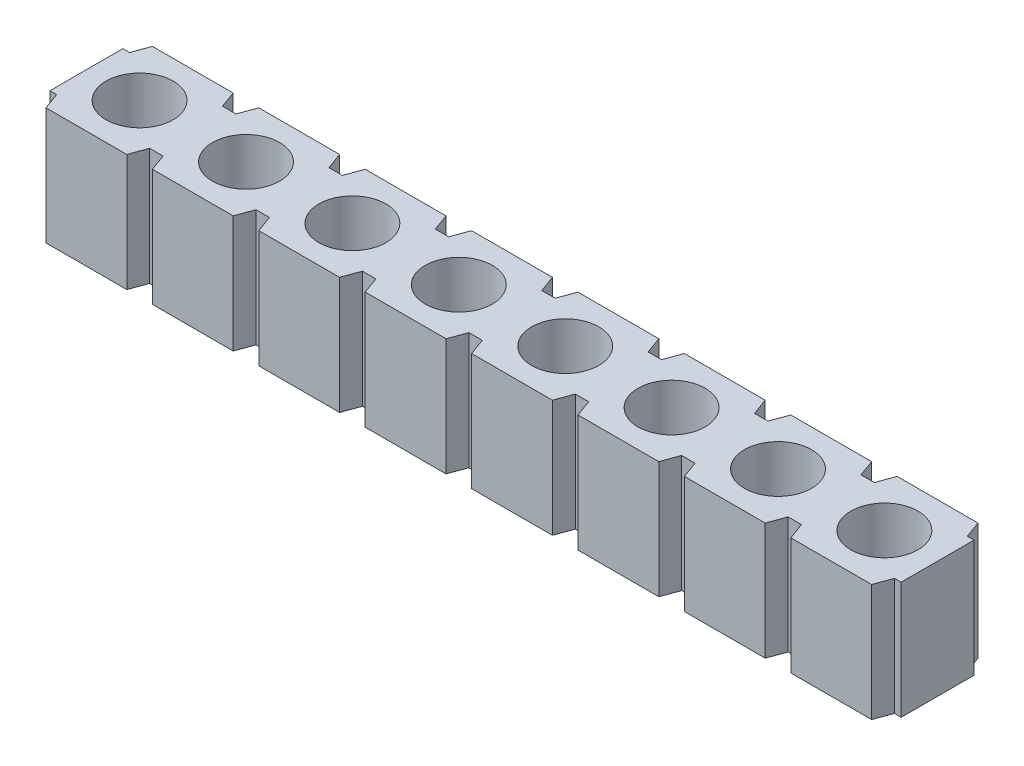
ISO-10303-21;
HEADER;
FILE_DESCRIPTION(('STEP AP214'),'2;1');
FILE_NAME('part.step','',(''),(''),'','','');
FILE_SCHEMA(('AUTOMOTIVE_DESIGN { 1 0 10303 214 1 1 1 1 }'));
ENDSEC;
DATA;
#1=APPLICATION_CONTEXT('core data for automotive mechanical design processes');
#2=APPLICATION_PROTOCOL_DEFINITION('international standard','automotive_design',2000,#1);
#3=PRODUCT_CONTEXT('',#1,'mechanical');
#4=PRODUCT('Part','Part','',(#3));
#5=PRODUCT_RELATED_PRODUCT_CATEGORY('part','',(#4));
#6=PRODUCT_DEFINITION_FORMATION('','',#4);
#7=PRODUCT_DEFINITION_CONTEXT('part definition',#1,'design');
#8=PRODUCT_DEFINITION('design','',#6,#7);
#9=PRODUCT_DEFINITION_SHAPE('','',#8);
#10=(LENGTH_UNIT() NAMED_UNIT(*) SI_UNIT(.MILLI.,.METRE.));
#11=(NAMED_UNIT(*) PLANE_ANGLE_UNIT() SI_UNIT($,.RADIAN.));
#12=(NAMED_UNIT(*) SI_UNIT($,.STERADIAN.) SOLID_ANGLE_UNIT());
#13=UNCERTAINTY_MEASURE_WITH_UNIT(LENGTH_MEASURE(1.E-05),#10,'distance_accuracy_value','');
#14=(GEOMETRIC_REPRESENTATION_CONTEXT(3) GLOBAL_UNCERTAINTY_ASSIGNED_CONTEXT((#13)) GLOBAL_UNIT_ASSIGNED_CONTEXT((#10,
#11,#12)) REPRESENTATION_CONTEXT('',''));
#15=CARTESIAN_POINT('',(0.,0.,0.));
#16=DIRECTION('',(0.,0.,1.));
#17=DIRECTION('',(1.,0.,0.));
#18=AXIS2_PLACEMENT_3D('',#15,#16,#17);
#19=CARTESIAN_POINT('',(19.7087474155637,-2.794,-2.53999999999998));
#20=DIRECTION('',(0.,0.,-1.));
#21=DIRECTION('',(-1.,0.,0.));
#22=AXIS2_PLACEMENT_3D('',#19,#20,#21);
#23=PLANE('',#22);
#24=DIRECTION('',(0.,1.,0.));
#25=VECTOR('',#24,1.);
#26=CARTESIAN_POINT('',(17.1687728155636,-2.794,-2.54));
#27=LINE('',#26,#25);
#28=CARTESIAN_POINT('',(17.1687728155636,-2.794,-2.54));
#29=VERTEX_POINT('',#28);
#30=CARTESIAN_POINT('',(17.1687728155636,0.,-2.54));
#31=VERTEX_POINT('',#30);
#32=EDGE_CURVE('E494',#29,#31,#27,.T.);
#33=ORIENTED_EDGE('',*,*,#32,.F.);
#34=DIRECTION('',(-1.,0.,0.));
#35=VECTOR('',#34,1.);
#36=CARTESIAN_POINT('',(19.7087474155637,-2.794,-2.53999999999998));
#37=LINE('',#36,#35);
#38=CARTESIAN_POINT('',(15.2399746,-2.794,-2.54));
#39=VERTEX_POINT('',#38);
#40=EDGE_CURVE('E485',#29,#39,#37,.T.);
#41=ORIENTED_EDGE('',*,*,#40,.T.);
#42=DIRECTION('',(0.,1.,0.));
#43=VECTOR('',#42,1.);
#44=CARTESIAN_POINT('',(15.2399746,-2.794,-2.54));
#45=LINE('',#44,#43);
#46=CARTESIAN_POINT('',(15.2399746,0.,-2.54));
#47=VERTEX_POINT('',#46);
#48=EDGE_CURVE('E544',#39,#47,#45,.T.);
#49=ORIENTED_EDGE('',*,*,#48,.T.);
#50=DIRECTION('',(-1.,0.,0.));
#51=VECTOR('',#50,1.);
#52=CARTESIAN_POINT('',(19.7087474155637,0.,-2.53999999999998));
#53=LINE('',#52,#51);
#54=EDGE_CURVE('E962',#31,#47,#53,.T.);
#55=ORIENTED_EDGE('',*,*,#54,.F.);
#56=EDGE_LOOP('',(#33,#41,#49,#55));
#57=FACE_BOUND('',#56,.T.);
#58=ADVANCED_FACE('F38',(#57),#23,.T.);
#59=CARTESIAN_POINT('',(0.,-2.794,0.));
#60=DIRECTION('',(0.,0.,1.));
#61=DIRECTION('',(1.,0.,0.));
#62=AXIS2_PLACEMENT_3D('',#59,#60,#61);
#63=PLANE('',#62);
#64=DIRECTION('',(0.,1.,0.));
#65=VECTOR('',#64,1.);
#66=CARTESIAN_POINT('',(17.7799746,-2.794,0.));
#67=LINE('',#66,#65);
#68=CARTESIAN_POINT('',(17.7799746,-2.794,0.));
#69=VERTEX_POINT('',#68);
#70=CARTESIAN_POINT('',(17.7799746,0.,0.));
#71=VERTEX_POINT('',#70);
#72=EDGE_CURVE('E516',#69,#71,#67,.T.);
#73=ORIENTED_EDGE('',*,*,#72,.F.);
#74=DIRECTION('',(1.,0.,0.));
#75=VECTOR('',#74,1.);
#76=CARTESIAN_POINT('',(0.,-2.794,0.));
#77=LINE('',#76,#75);
#78=CARTESIAN_POINT('',(19.7087474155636,-2.794,0.));
#79=VERTEX_POINT('',#78);
#80=EDGE_CURVE('E906',#69,#79,#77,.T.);
#81=ORIENTED_EDGE('',*,*,#80,.T.);
#82=DIRECTION('',(0.,1.,0.));
#83=VECTOR('',#82,1.);
#84=CARTESIAN_POINT('',(19.7087474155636,-2.794,0.));
#85=LINE('',#84,#83);
#86=CARTESIAN_POINT('',(19.7087474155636,0.,0.));
#87=VERTEX_POINT('',#86);
#88=EDGE_CURVE('E975',#79,#87,#85,.T.);
#89=ORIENTED_EDGE('',*,*,#88,.T.);
#90=DIRECTION('',(1.,0.,0.));
#91=VECTOR('',#90,1.);
#92=CARTESIAN_POINT('',(0.,0.,0.));
#93=LINE('',#92,#91);
#94=EDGE_CURVE('E942',#71,#87,#93,.T.);
#95=ORIENTED_EDGE('',*,*,#94,.F.);
#96=EDGE_LOOP('',(#73,#81,#89,#95));
#97=FACE_BOUND('',#96,.T.);
#98=ADVANCED_FACE('F1068',(#97),#63,.T.);
#99=DIRECTION('',(0.,1.,0.));
#100=VECTOR('',#99,1.);
#101=CARTESIAN_POINT('',(14.6287728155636,-2.794,-2.54));
#102=LINE('',#101,#100);
#103=CARTESIAN_POINT('',(14.6287728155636,-2.794,-2.54));
#104=VERTEX_POINT('',#103);
#105=CARTESIAN_POINT('',(14.6287728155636,0.,-2.54));
#106=VERTEX_POINT('',#105);
#107=EDGE_CURVE('E541',#104,#106,#102,.T.);
#108=ORIENTED_EDGE('',*,*,#107,.F.);
#109=CARTESIAN_POINT('',(12.6999746,-2.794,-2.54));
#110=VERTEX_POINT('',#109);
#111=EDGE_CURVE('E1251',#104,#110,#37,.T.);
#112=ORIENTED_EDGE('',*,*,#111,.T.);
#113=DIRECTION('',(0.,1.,0.));
#114=VECTOR('',#113,1.);
#115=CARTESIAN_POINT('',(12.6999746,-2.794,-2.54));
#116=LINE('',#115,#114);
#117=CARTESIAN_POINT('',(12.6999746,0.,-2.54));
#118=VERTEX_POINT('',#117);
#119=EDGE_CURVE('E597',#110,#118,#116,.T.);
#120=ORIENTED_EDGE('',*,*,#119,.T.);
#121=EDGE_CURVE('E1279',#106,#118,#53,.T.);
#122=ORIENTED_EDGE('',*,*,#121,.F.);
#123=EDGE_LOOP('',(#108,#112,#120,#122));
#124=FACE_BOUND('',#123,.T.);
#125=ADVANCED_FACE('F1196',(#124),#23,.T.);
#126=DIRECTION('',(0.,1.,0.));
#127=VECTOR('',#126,1.);
#128=CARTESIAN_POINT('',(17.1687728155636,-2.794,0.));
#129=LINE('',#128,#127);
#130=CARTESIAN_POINT('',(17.1687728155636,-2.794,0.));
#131=VERTEX_POINT('',#130);
#132=CARTESIAN_POINT('',(17.1687728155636,0.,0.));
#133=VERTEX_POINT('',#132);
#134=EDGE_CURVE('E519',#131,#133,#129,.T.);
#135=ORIENTED_EDGE('',*,*,#134,.T.);
#136=CARTESIAN_POINT('',(15.2399746,0.,0.));
#137=VERTEX_POINT('',#136);
#138=EDGE_CURVE('E1054',#137,#133,#93,.T.);
#139=ORIENTED_EDGE('',*,*,#138,.F.);
#140=DIRECTION('',(0.,1.,0.));
#141=VECTOR('',#140,1.);
#142=CARTESIAN_POINT('',(15.2399746,-2.794,0.));
#143=LINE('',#142,#141);
#144=CARTESIAN_POINT('',(15.2399746,-2.794,0.));
#145=VERTEX_POINT('',#144);
#146=EDGE_CURVE('E567',#145,#137,#143,.T.);
#147=ORIENTED_EDGE('',*,*,#146,.F.);
#148=EDGE_CURVE('E1098',#145,#131,#77,.T.);
#149=ORIENTED_EDGE('',*,*,#148,.T.);
#150=EDGE_LOOP('',(#135,#139,#147,#149));
#151=FACE_BOUND('',#150,.T.);
#152=ADVANCED_FACE('F1172',(#151),#63,.T.);
#153=DIRECTION('',(0.,1.,0.));
#154=VECTOR('',#153,1.);
#155=CARTESIAN_POINT('',(12.0887728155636,-2.794,-2.54));
#156=LINE('',#155,#154);
#157=CARTESIAN_POINT('',(12.0887728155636,-2.794,-2.54));
#158=VERTEX_POINT('',#157);
#159=CARTESIAN_POINT('',(12.0887728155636,0.,-2.54));
#160=VERTEX_POINT('',#159);
#161=EDGE_CURVE('E594',#158,#160,#156,.T.);
#162=ORIENTED_EDGE('',*,*,#161,.F.);
#163=CARTESIAN_POINT('',(10.1599746,-2.794,-2.54));
#164=VERTEX_POINT('',#163);
#165=EDGE_CURVE('E1245',#158,#164,#37,.T.);
#166=ORIENTED_EDGE('',*,*,#165,.T.);
#167=DIRECTION('',(0.,1.,0.));
#168=VECTOR('',#167,1.);
#169=CARTESIAN_POINT('',(10.1599746,-2.794,-2.54));
#170=LINE('',#169,#168);
#171=CARTESIAN_POINT('',(10.1599746,0.,-2.54));
#172=VERTEX_POINT('',#171);
#173=EDGE_CURVE('E650',#164,#172,#170,.T.);
#174=ORIENTED_EDGE('',*,*,#173,.T.);
#175=EDGE_CURVE('E1247',#160,#172,#53,.T.);
#176=ORIENTED_EDGE('',*,*,#175,.F.);
#177=EDGE_LOOP('',(#162,#166,#174,#176));
#178=FACE_BOUND('',#177,.T.);
#179=ADVANCED_FACE('F1205',(#178),#23,.T.);
#180=DIRECTION('',(0.,1.,0.));
#181=VECTOR('',#180,1.);
#182=CARTESIAN_POINT('',(14.6287728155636,-2.794,0.));
#183=LINE('',#182,#181);
#184=CARTESIAN_POINT('',(14.6287728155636,-2.794,0.));
#185=VERTEX_POINT('',#184);
#186=CARTESIAN_POINT('',(14.6287728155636,0.,0.));
#187=VERTEX_POINT('',#186);
#188=EDGE_CURVE('E570',#185,#187,#183,.T.);
#189=ORIENTED_EDGE('',*,*,#188,.T.);
#190=CARTESIAN_POINT('',(12.6999746,0.,0.));
#191=VERTEX_POINT('',#190);
#192=EDGE_CURVE('E1049',#191,#187,#93,.T.);
#193=ORIENTED_EDGE('',*,*,#192,.F.);
#194=DIRECTION('',(0.,1.,0.));
#195=VECTOR('',#194,1.);
#196=CARTESIAN_POINT('',(12.6999746,-2.794,0.));
#197=LINE('',#196,#195);
#198=CARTESIAN_POINT('',(12.6999746,-2.794,0.));
#199=VERTEX_POINT('',#198);
#200=EDGE_CURVE('E620',#199,#191,#197,.T.);
#201=ORIENTED_EDGE('',*,*,#200,.F.);
#202=EDGE_CURVE('E1100',#199,#185,#77,.T.);
#203=ORIENTED_EDGE('',*,*,#202,.T.);
#204=EDGE_LOOP('',(#189,#193,#201,#203));
#205=FACE_BOUND('',#204,.T.);
#206=ADVANCED_FACE('F1162',(#205),#63,.T.);
#207=DIRECTION('',(0.,1.,0.));
#208=VECTOR('',#207,1.);
#209=CARTESIAN_POINT('',(9.54877281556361,-2.794,-2.54));
#210=LINE('',#209,#208);
#211=CARTESIAN_POINT('',(9.54877281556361,-2.794,-2.54));
#212=VERTEX_POINT('',#211);
#213=CARTESIAN_POINT('',(9.54877281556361,0.,-2.54));
#214=VERTEX_POINT('',#213);
#215=EDGE_CURVE('E647',#212,#214,#210,.T.);
#216=ORIENTED_EDGE('',*,*,#215,.F.);
#217=CARTESIAN_POINT('',(7.6199746,-2.794,-2.54));
#218=VERTEX_POINT('',#217);
#219=EDGE_CURVE('E1252',#212,#218,#37,.T.);
#220=ORIENTED_EDGE('',*,*,#219,.T.);
#221=DIRECTION('',(0.,1.,0.));
#222=VECTOR('',#221,1.);
#223=CARTESIAN_POINT('',(7.6199746,-2.794,-2.54));
#224=LINE('',#223,#222);
#225=CARTESIAN_POINT('',(7.6199746,0.,-2.54));
#226=VERTEX_POINT('',#225);
#227=EDGE_CURVE('E703',#218,#226,#224,.T.);
#228=ORIENTED_EDGE('',*,*,#227,.T.);
#229=EDGE_CURVE('E1272',#214,#226,#53,.T.);
#230=ORIENTED_EDGE('',*,*,#229,.F.);
#231=EDGE_LOOP('',(#216,#220,#228,#230));
#232=FACE_BOUND('',#231,.T.);
#233=ADVANCED_FACE('F1226',(#232),#23,.T.);
#234=DIRECTION('',(0.,1.,0.));
#235=VECTOR('',#234,1.);
#236=CARTESIAN_POINT('',(12.0887728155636,-2.794,0.));
#237=LINE('',#236,#235);
#238=CARTESIAN_POINT('',(12.0887728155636,-2.794,0.));
#239=VERTEX_POINT('',#238);
#240=CARTESIAN_POINT('',(12.0887728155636,0.,0.));
#241=VERTEX_POINT('',#240);
#242=EDGE_CURVE('E623',#239,#241,#237,.T.);
#243=ORIENTED_EDGE('',*,*,#242,.T.);
#244=CARTESIAN_POINT('',(10.1599746,0.,0.));
#245=VERTEX_POINT('',#244);
#246=EDGE_CURVE('E1044',#245,#241,#93,.T.);
#247=ORIENTED_EDGE('',*,*,#246,.F.);
#248=DIRECTION('',(0.,1.,0.));
#249=VECTOR('',#248,1.);
#250=CARTESIAN_POINT('',(10.1599746,-2.794,0.));
#251=LINE('',#250,#249);
#252=CARTESIAN_POINT('',(10.1599746,-2.794,0.));
#253=VERTEX_POINT('',#252);
#254=EDGE_CURVE('E673',#253,#245,#251,.T.);
#255=ORIENTED_EDGE('',*,*,#254,.F.);
#256=EDGE_CURVE('E1105',#253,#239,#77,.T.);
#257=ORIENTED_EDGE('',*,*,#256,.T.);
#258=EDGE_LOOP('',(#243,#247,#255,#257));
#259=FACE_BOUND('',#258,.T.);
#260=ADVANCED_FACE('F1152',(#259),#63,.T.);
#261=DIRECTION('',(0.,1.,0.));
#262=VECTOR('',#261,1.);
#263=CARTESIAN_POINT('',(7.00877281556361,-2.794,-2.54));
#264=LINE('',#263,#262);
#265=CARTESIAN_POINT('',(7.00877281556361,-2.794,-2.54));
#266=VERTEX_POINT('',#265);
#267=CARTESIAN_POINT('',(7.00877281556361,0.,-2.54));
#268=VERTEX_POINT('',#267);
#269=EDGE_CURVE('E700',#266,#268,#264,.T.);
#270=ORIENTED_EDGE('',*,*,#269,.F.);
#271=CARTESIAN_POINT('',(5.0799746,-2.794,-2.54));
#272=VERTEX_POINT('',#271);
#273=EDGE_CURVE('E1253',#266,#272,#37,.T.);
#274=ORIENTED_EDGE('',*,*,#273,.T.);
#275=DIRECTION('',(0.,1.,0.));
#276=VECTOR('',#275,1.);
#277=CARTESIAN_POINT('',(5.0799746,-2.794,-2.54));
#278=LINE('',#277,#276);
#279=CARTESIAN_POINT('',(5.0799746,0.,-2.54));
#280=VERTEX_POINT('',#279);
#281=EDGE_CURVE('E756',#272,#280,#278,.T.);
#282=ORIENTED_EDGE('',*,*,#281,.T.);
#283=EDGE_CURVE('E1271',#268,#280,#53,.T.);
#284=ORIENTED_EDGE('',*,*,#283,.F.);
#285=EDGE_LOOP('',(#270,#274,#282,#284));
#286=FACE_BOUND('',#285,.T.);
#287=ADVANCED_FACE('F1219',(#286),#23,.T.);
#288=DIRECTION('',(0.,1.,0.));
#289=VECTOR('',#288,1.);
#290=CARTESIAN_POINT('',(9.54877281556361,-2.794,0.));
#291=LINE('',#290,#289);
#292=CARTESIAN_POINT('',(9.54877281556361,-2.794,0.));
#293=VERTEX_POINT('',#292);
#294=CARTESIAN_POINT('',(9.54877281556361,0.,0.));
#295=VERTEX_POINT('',#294);
#296=EDGE_CURVE('E676',#293,#295,#291,.T.);
#297=ORIENTED_EDGE('',*,*,#296,.T.);
#298=CARTESIAN_POINT('',(7.6199746,0.,0.));
#299=VERTEX_POINT('',#298);
#300=EDGE_CURVE('E1039',#299,#295,#93,.T.);
#301=ORIENTED_EDGE('',*,*,#300,.F.);
#302=DIRECTION('',(0.,1.,0.));
#303=VECTOR('',#302,1.);
#304=CARTESIAN_POINT('',(7.6199746,-2.794,0.));
#305=LINE('',#304,#303);
#306=CARTESIAN_POINT('',(7.6199746,-2.794,0.));
#307=VERTEX_POINT('',#306);
#308=EDGE_CURVE('E726',#307,#299,#305,.T.);
#309=ORIENTED_EDGE('',*,*,#308,.F.);
#310=EDGE_CURVE('E1110',#307,#293,#77,.T.);
#311=ORIENTED_EDGE('',*,*,#310,.T.);
#312=EDGE_LOOP('',(#297,#301,#309,#311));
#313=FACE_BOUND('',#312,.T.);
#314=ADVANCED_FACE('F1142',(#313),#63,.T.);
#315=DIRECTION('',(0.,1.,0.));
#316=VECTOR('',#315,1.);
#317=CARTESIAN_POINT('',(4.46877281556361,-2.794,-2.54));
#318=LINE('',#317,#316);
#319=CARTESIAN_POINT('',(4.46877281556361,-2.794,-2.54));
#320=VERTEX_POINT('',#319);
#321=CARTESIAN_POINT('',(4.46877281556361,0.,-2.54));
#322=VERTEX_POINT('',#321);
#323=EDGE_CURVE('E753',#320,#322,#318,.T.);
#324=ORIENTED_EDGE('',*,*,#323,.F.);
#325=CARTESIAN_POINT('',(2.5399746,-2.794,-2.54));
#326=VERTEX_POINT('',#325);
#327=EDGE_CURVE('E1256',#320,#326,#37,.T.);
#328=ORIENTED_EDGE('',*,*,#327,.T.);
#329=DIRECTION('',(0.,1.,0.));
#330=VECTOR('',#329,1.);
#331=CARTESIAN_POINT('',(2.5399746,-2.794,-2.54));
#332=LINE('',#331,#330);
#333=CARTESIAN_POINT('',(2.5399746,0.,-2.54));
#334=VERTEX_POINT('',#333);
#335=EDGE_CURVE('E851',#326,#334,#332,.T.);
#336=ORIENTED_EDGE('',*,*,#335,.T.);
#337=EDGE_CURVE('E1000',#322,#334,#53,.T.);
#338=ORIENTED_EDGE('',*,*,#337,.F.);
#339=EDGE_LOOP('',(#324,#328,#336,#338));
#340=FACE_BOUND('',#339,.T.);
#341=ADVANCED_FACE('F1212',(#340),#23,.T.);
#342=DIRECTION('',(0.,1.,0.));
#343=VECTOR('',#342,1.);
#344=CARTESIAN_POINT('',(7.00877281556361,-2.794,0.));
#345=LINE('',#344,#343);
#346=CARTESIAN_POINT('',(7.00877281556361,-2.794,0.));
#347=VERTEX_POINT('',#346);
#348=CARTESIAN_POINT('',(7.00877281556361,0.,0.));
#349=VERTEX_POINT('',#348);
#350=EDGE_CURVE('E729',#347,#349,#345,.T.);
#351=ORIENTED_EDGE('',*,*,#350,.T.);
#352=CARTESIAN_POINT('',(5.0799746,0.,0.));
#353=VERTEX_POINT('',#352);
#354=EDGE_CURVE('E1037',#353,#349,#93,.T.);
#355=ORIENTED_EDGE('',*,*,#354,.F.);
#356=DIRECTION('',(0.,1.,0.));
#357=VECTOR('',#356,1.);
#358=CARTESIAN_POINT('',(5.0799746,-2.794,0.));
#359=LINE('',#358,#357);
#360=CARTESIAN_POINT('',(5.0799746,-2.794,0.));
#361=VERTEX_POINT('',#360);
#362=EDGE_CURVE('E779',#361,#353,#359,.T.);
#363=ORIENTED_EDGE('',*,*,#362,.F.);
#364=EDGE_CURVE('E1115',#361,#347,#77,.T.);
#365=ORIENTED_EDGE('',*,*,#364,.T.);
#366=EDGE_LOOP('',(#351,#355,#363,#365));
#367=FACE_BOUND('',#366,.T.);
#368=ADVANCED_FACE('F1132',(#367),#63,.T.);
#369=DIRECTION('',(0.,1.,0.));
#370=VECTOR('',#369,1.);
#371=CARTESIAN_POINT('',(1.92877281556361,-2.794,-2.54));
#372=LINE('',#371,#370);
#373=CARTESIAN_POINT('',(1.92877281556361,-2.794,-2.54));
#374=VERTEX_POINT('',#373);
#375=CARTESIAN_POINT('',(1.92877281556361,0.,-2.54));
#376=VERTEX_POINT('',#375);
#377=EDGE_CURVE('E848',#374,#376,#372,.T.);
#378=ORIENTED_EDGE('',*,*,#377,.F.);
#379=CARTESIAN_POINT('',(0.,-2.794,-2.54));
#380=VERTEX_POINT('',#379);
#381=EDGE_CURVE('E924',#374,#380,#37,.T.);
#382=ORIENTED_EDGE('',*,*,#381,.T.);
#383=DIRECTION('',(0.,1.,0.));
#384=VECTOR('',#383,1.);
#385=CARTESIAN_POINT('',(0.,-2.794,-2.54));
#386=LINE('',#385,#384);
#387=CARTESIAN_POINT('',(0.,0.,-2.54));
#388=VERTEX_POINT('',#387);
#389=EDGE_CURVE('E11',#380,#388,#386,.T.);
#390=ORIENTED_EDGE('',*,*,#389,.T.);
#391=EDGE_CURVE('E960',#376,#388,#53,.T.);
#392=ORIENTED_EDGE('',*,*,#391,.F.);
#393=EDGE_LOOP('',(#378,#382,#390,#392));
#394=FACE_BOUND('',#393,.T.);
#395=ADVANCED_FACE('F1001',(#394),#23,.T.);
#396=DIRECTION('',(0.,1.,0.));
#397=VECTOR('',#396,1.);
#398=CARTESIAN_POINT('',(4.46877281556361,-2.794,0.));
#399=LINE('',#398,#397);
#400=CARTESIAN_POINT('',(4.46877281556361,-2.794,0.));
#401=VERTEX_POINT('',#400);
#402=CARTESIAN_POINT('',(4.46877281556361,0.,0.));
#403=VERTEX_POINT('',#402);
#404=EDGE_CURVE('E782',#401,#403,#399,.T.);
#405=ORIENTED_EDGE('',*,*,#404,.T.);
#406=CARTESIAN_POINT('',(2.5399746,0.,0.));
#407=VERTEX_POINT('',#406);
#408=EDGE_CURVE('E947',#407,#403,#93,.T.);
#409=ORIENTED_EDGE('',*,*,#408,.F.);
#410=DIRECTION('',(0.,1.,0.));
#411=VECTOR('',#410,1.);
#412=CARTESIAN_POINT('',(2.5399746,-2.794,0.));
#413=LINE('',#412,#411);
#414=CARTESIAN_POINT('',(2.5399746,-2.794,0.));
#415=VERTEX_POINT('',#414);
#416=EDGE_CURVE('E874',#415,#407,#413,.T.);
#417=ORIENTED_EDGE('',*,*,#416,.F.);
#418=EDGE_CURVE('E911',#415,#401,#77,.T.);
#419=ORIENTED_EDGE('',*,*,#418,.T.);
#420=EDGE_LOOP('',(#405,#409,#417,#419));
#421=FACE_BOUND('',#420,.T.);
#422=ADVANCED_FACE('F1034',(#421),#63,.T.);
#423=CARTESIAN_POINT('',(0.,-2.794,-2.54));
#424=DIRECTION('',(-0.93969262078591,0.,-0.342020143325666));
#425=DIRECTION('',(-0.342020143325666,0.,0.93969262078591));
#426=AXIS2_PLACEMENT_3D('',#423,#424,#425);
#427=PLANE('',#426);
#428=DIRECTION('',(-0.342020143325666,0.,0.939692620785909));
#429=VECTOR('',#428,1.);
#430=CARTESIAN_POINT('',(0.,0.,-2.54));
#431=LINE('',#430,#429);
#432=CARTESIAN_POINT('',(-0.145606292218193,0.,-2.13995));
#433=VERTEX_POINT('',#432);
#434=EDGE_CURVE('E889',#388,#433,#431,.T.);
#435=ORIENTED_EDGE('',*,*,#434,.F.);
#436=ORIENTED_EDGE('',*,*,#389,.F.);
#437=DIRECTION('',(-0.342020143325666,0.,0.939692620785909));
#438=VECTOR('',#437,1.);
#439=CARTESIAN_POINT('',(0.,-2.794,-2.54));
#440=LINE('',#439,#438);
#441=CARTESIAN_POINT('',(-0.145606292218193,-2.794,-2.13995));
#442=VERTEX_POINT('',#441);
#443=EDGE_CURVE('E890',#380,#442,#440,.T.);
#444=ORIENTED_EDGE('',*,*,#443,.T.);
#445=DIRECTION('',(0.,1.,0.));
#446=VECTOR('',#445,1.);
#447=CARTESIAN_POINT('',(-0.145606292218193,-2.794,-2.13995));
#448=LINE('',#447,#446);
#449=EDGE_CURVE('E42',#442,#433,#448,.T.);
#450=ORIENTED_EDGE('',*,*,#449,.T.);
#451=EDGE_LOOP('',(#435,#436,#444,#450));
#452=FACE_BOUND('',#451,.T.);
#453=ADVANCED_FACE('F40',(#452),#427,.T.);
#454=DIRECTION('',(0.,1.,0.));
#455=VECTOR('',#454,1.);
#456=CARTESIAN_POINT('',(17.7799746,-2.794,-2.54));
#457=LINE('',#456,#455);
#458=CARTESIAN_POINT('',(17.7799746,-2.794,-2.54));
#459=VERTEX_POINT('',#458);
#460=CARTESIAN_POINT('',(17.7799746,0.,-2.54));
#461=VERTEX_POINT('',#460);
#462=EDGE_CURVE('E496',#459,#461,#457,.T.);
#463=ORIENTED_EDGE('',*,*,#462,.T.);
#464=CARTESIAN_POINT('',(19.7087474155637,0.,-2.53999999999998));
#465=VERTEX_POINT('',#464);
#466=EDGE_CURVE('E894',#465,#461,#53,.T.);
#467=ORIENTED_EDGE('',*,*,#466,.F.);
#468=DIRECTION('',(0.,1.,0.));
#469=VECTOR('',#468,1.);
#470=CARTESIAN_POINT('',(19.7087474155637,-2.794,-2.53999999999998));
#471=LINE('',#470,#469);
#472=CARTESIAN_POINT('',(19.7087474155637,-2.794,-2.53999999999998));
#473=VERTEX_POINT('',#472);
#474=EDGE_CURVE('E47',#473,#465,#471,.T.);
#475=ORIENTED_EDGE('',*,*,#474,.F.);
#476=EDGE_CURVE('E925',#473,#459,#37,.T.);
#477=ORIENTED_EDGE('',*,*,#476,.T.);
#478=EDGE_LOOP('',(#463,#467,#475,#477));
#479=FACE_BOUND('',#478,.T.);
#480=ADVANCED_FACE('F1094',(#479),#23,.T.);
#481=CARTESIAN_POINT('',(19.7087474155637,-2.794,-2.53999999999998));
#482=DIRECTION('',(0.939692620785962,0.,-0.342020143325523));
#483=DIRECTION('',(-0.342020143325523,0.,-0.939692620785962));
#484=AXIS2_PLACEMENT_3D('',#481,#482,#483);
#485=PLANE('',#484);
#486=DIRECTION('',(-0.342020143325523,0.,-0.939692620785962));
#487=VECTOR('',#486,1.);
#488=CARTESIAN_POINT('',(19.7087474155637,0.,-2.53999999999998));
#489=LINE('',#488,#487);
#490=CARTESIAN_POINT('',(19.8543537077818,0.,-2.13994999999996));
#491=VERTEX_POINT('',#490);
#492=EDGE_CURVE('E957',#491,#465,#489,.T.);
#493=ORIENTED_EDGE('',*,*,#492,.F.);
#494=DIRECTION('',(0.,1.,0.));
#495=VECTOR('',#494,1.);
#496=CARTESIAN_POINT('',(19.8543537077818,-2.794,-2.13994999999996));
#497=LINE('',#496,#495);
#498=CARTESIAN_POINT('',(19.8543537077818,-2.794,-2.13994999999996));
#499=VERTEX_POINT('',#498);
#500=EDGE_CURVE('E965',#499,#491,#497,.T.);
#501=ORIENTED_EDGE('',*,*,#500,.F.);
#502=DIRECTION('',(-0.342020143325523,0.,-0.939692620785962));
#503=VECTOR('',#502,1.);
#504=CARTESIAN_POINT('',(19.7087474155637,-2.794,-2.53999999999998));
#505=LINE('',#504,#503);
#506=EDGE_CURVE('E921',#499,#473,#505,.T.);
#507=ORIENTED_EDGE('',*,*,#506,.T.);
#508=ORIENTED_EDGE('',*,*,#474,.T.);
#509=EDGE_LOOP('',(#493,#501,#507,#508));
#510=FACE_BOUND('',#509,.T.);
#511=ADVANCED_FACE('F1090',(#510),#485,.T.);
#512=CARTESIAN_POINT('',(20.0143737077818,-2.794,-2.13994999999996));
#513=DIRECTION('',(0.,0.,-1.));
#514=DIRECTION('',(-1.,0.,0.));
#515=AXIS2_PLACEMENT_3D('',#512,#513,#514);
#516=PLANE('',#515);
#517=ORIENTED_EDGE('',*,*,#500,.T.);
#518=DIRECTION('',(-1.,0.,0.));
#519=VECTOR('',#518,1.);
#520=CARTESIAN_POINT('',(20.0143737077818,0.,-2.13994999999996));
#521=LINE('',#520,#519);
#522=CARTESIAN_POINT('',(20.0143737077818,0.,-2.13994999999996));
#523=VERTEX_POINT('',#522);
#524=EDGE_CURVE('E955',#523,#491,#521,.T.);
#525=ORIENTED_EDGE('',*,*,#524,.F.);
#526=DIRECTION('',(0.,1.,0.));
#527=VECTOR('',#526,1.);
#528=CARTESIAN_POINT('',(20.0143737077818,-2.794,-2.13994999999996));
#529=LINE('',#528,#527);
#530=CARTESIAN_POINT('',(20.0143737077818,-2.794,-2.13994999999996));
#531=VERTEX_POINT('',#530);
#532=EDGE_CURVE('E968',#531,#523,#529,.T.);
#533=ORIENTED_EDGE('',*,*,#532,.F.);
#534=DIRECTION('',(-1.,0.,0.));
#535=VECTOR('',#534,1.);
#536=CARTESIAN_POINT('',(20.0143737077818,-2.794,-2.13994999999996));
#537=LINE('',#536,#535);
#538=EDGE_CURVE('E919',#531,#499,#537,.T.);
#539=ORIENTED_EDGE('',*,*,#538,.T.);
#540=EDGE_LOOP('',(#517,#525,#533,#539));
#541=FACE_BOUND('',#540,.T.);
#542=ADVANCED_FACE('F1085',(#541),#516,.T.);
#543=CARTESIAN_POINT('',(20.0143737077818,-2.794,-2.13994999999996));
#544=DIRECTION('',(1.,0.,0.));
#545=DIRECTION('',(0.,0.,-1.));
#546=AXIS2_PLACEMENT_3D('',#543,#544,#545);
#547=PLANE('',#546);
#548=DIRECTION('',(0.,0.,-1.));
#549=VECTOR('',#548,1.);
#550=CARTESIAN_POINT('',(20.0143737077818,0.,-2.13994999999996));
#551=LINE('',#550,#549);
#552=CARTESIAN_POINT('',(20.0143737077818,0.,-0.400049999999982));
#553=VERTEX_POINT('',#552);
#554=EDGE_CURVE('E952',#553,#523,#551,.T.);
#555=ORIENTED_EDGE('',*,*,#554,.F.);
#556=DIRECTION('',(0.,1.,0.));
#557=VECTOR('',#556,1.);
#558=CARTESIAN_POINT('',(20.0143737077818,-2.794,-0.400049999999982));
#559=LINE('',#558,#557);
#560=CARTESIAN_POINT('',(20.0143737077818,-2.794,-0.400049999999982));
#561=VERTEX_POINT('',#560);
#562=EDGE_CURVE('E970',#561,#553,#559,.T.);
#563=ORIENTED_EDGE('',*,*,#562,.F.);
#564=DIRECTION('',(0.,0.,-1.));
#565=VECTOR('',#564,1.);
#566=CARTESIAN_POINT('',(20.0143737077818,-2.794,-2.13994999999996));
#567=LINE('',#566,#565);
#568=EDGE_CURVE('E916',#561,#531,#567,.T.);
#569=ORIENTED_EDGE('',*,*,#568,.T.);
#570=ORIENTED_EDGE('',*,*,#532,.T.);
#571=EDGE_LOOP('',(#555,#563,#569,#570));
#572=FACE_BOUND('',#571,.T.);
#573=ADVANCED_FACE('F1081',(#572),#547,.T.);
#574=CARTESIAN_POINT('',(20.0143737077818,-2.794,-0.400049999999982));
#575=DIRECTION('',(0.,0.,1.));
#576=DIRECTION('',(1.,0.,0.));
#577=AXIS2_PLACEMENT_3D('',#574,#575,#576);
#578=PLANE('',#577);
#579=DIRECTION('',(1.,0.,0.));
#580=VECTOR('',#579,1.);
#581=CARTESIAN_POINT('',(20.0143737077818,-2.794,-0.400049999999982));
#582=LINE('',#581,#580);
#583=CARTESIAN_POINT('',(19.8543537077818,-2.794,-0.400049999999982));
#584=VERTEX_POINT('',#583);
#585=EDGE_CURVE('E914',#584,#561,#582,.T.);
#586=ORIENTED_EDGE('',*,*,#585,.T.);
#587=ORIENTED_EDGE('',*,*,#562,.T.);
#588=DIRECTION('',(1.,0.,0.));
#589=VECTOR('',#588,1.);
#590=CARTESIAN_POINT('',(20.0143737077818,0.,-0.400049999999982));
#591=LINE('',#590,#589);
#592=CARTESIAN_POINT('',(19.8543537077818,0.,-0.400049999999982));
#593=VERTEX_POINT('',#592);
#594=EDGE_CURVE('E950',#593,#553,#591,.T.);
#595=ORIENTED_EDGE('',*,*,#594,.F.);
#596=DIRECTION('',(0.,1.,0.));
#597=VECTOR('',#596,1.);
#598=CARTESIAN_POINT('',(19.8543537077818,-2.794,-0.400049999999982));
#599=LINE('',#598,#597);
#600=EDGE_CURVE('E973',#584,#593,#599,.T.);
#601=ORIENTED_EDGE('',*,*,#600,.F.);
#602=EDGE_LOOP('',(#586,#587,#595,#601));
#603=FACE_BOUND('',#602,.T.);
#604=ADVANCED_FACE('F1076',(#603),#578,.T.);
#605=CARTESIAN_POINT('',(19.7087474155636,-2.794,0.));
#606=DIRECTION('',(0.939692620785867,0.,0.342020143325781));
#607=DIRECTION('',(0.342020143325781,0.,-0.939692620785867));
#608=AXIS2_PLACEMENT_3D('',#605,#606,#607);
#609=PLANE('',#608);
#610=DIRECTION('',(0.342020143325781,0.,-0.939692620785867));
#611=VECTOR('',#610,1.);
#612=CARTESIAN_POINT('',(19.7087474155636,0.,0.));
#613=LINE('',#612,#611);
#614=EDGE_CURVE('E946',#87,#593,#613,.T.);
#615=ORIENTED_EDGE('',*,*,#614,.F.);
#616=ORIENTED_EDGE('',*,*,#88,.F.);
#617=DIRECTION('',(0.342020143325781,0.,-0.939692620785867));
#618=VECTOR('',#617,1.);
#619=CARTESIAN_POINT('',(19.7087474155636,-2.794,0.));
#620=LINE('',#619,#618);
#621=EDGE_CURVE('E910',#79,#584,#620,.T.);
#622=ORIENTED_EDGE('',*,*,#621,.T.);
#623=ORIENTED_EDGE('',*,*,#600,.T.);
#624=EDGE_LOOP('',(#615,#616,#622,#623));
#625=FACE_BOUND('',#624,.T.);
#626=ADVANCED_FACE('F1072',(#625),#609,.T.);
#627=DIRECTION('',(0.,1.,0.));
#628=VECTOR('',#627,1.);
#629=CARTESIAN_POINT('',(1.92877281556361,-2.794,0.));
#630=LINE('',#629,#628);
#631=CARTESIAN_POINT('',(1.92877281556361,-2.794,0.));
#632=VERTEX_POINT('',#631);
#633=CARTESIAN_POINT('',(1.92877281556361,0.,0.));
#634=VERTEX_POINT('',#633);
#635=EDGE_CURVE('E877',#632,#634,#630,.T.);
#636=ORIENTED_EDGE('',*,*,#635,.T.);
#637=CARTESIAN_POINT('',(0.,0.,0.));
#638=VERTEX_POINT('',#637);
#639=EDGE_CURVE('E943',#638,#634,#93,.T.);
#640=ORIENTED_EDGE('',*,*,#639,.F.);
#641=DIRECTION('',(0.,1.,0.));
#642=VECTOR('',#641,1.);
#643=CARTESIAN_POINT('',(0.,-2.794,0.));
#644=LINE('',#643,#642);
#645=CARTESIAN_POINT('',(0.,-2.794,0.));
#646=VERTEX_POINT('',#645);
#647=EDGE_CURVE('E978',#646,#638,#644,.T.);
#648=ORIENTED_EDGE('',*,*,#647,.F.);
#649=EDGE_CURVE('E907',#646,#632,#77,.T.);
#650=ORIENTED_EDGE('',*,*,#649,.T.);
#651=EDGE_LOOP('',(#636,#640,#648,#650));
#652=FACE_BOUND('',#651,.T.);
#653=ADVANCED_FACE('F1017',(#652),#63,.T.);
#654=CARTESIAN_POINT('',(0.,-2.794,0.));
#655=DIRECTION('',(-0.939692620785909,0.,0.342020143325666));
#656=DIRECTION('',(0.342020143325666,0.,0.939692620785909));
#657=AXIS2_PLACEMENT_3D('',#654,#655,#656);
#658=PLANE('',#657);
#659=DIRECTION('',(0.342020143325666,0.,0.939692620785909));
#660=VECTOR('',#659,1.);
#661=CARTESIAN_POINT('',(0.,0.,0.));
#662=LINE('',#661,#660);
#663=CARTESIAN_POINT('',(-0.145606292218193,0.,-0.40005));
#664=VERTEX_POINT('',#663);
#665=EDGE_CURVE('E939',#664,#638,#662,.T.);
#666=ORIENTED_EDGE('',*,*,#665,.F.);
#667=DIRECTION('',(0.,1.,0.));
#668=VECTOR('',#667,1.);
#669=CARTESIAN_POINT('',(-0.145606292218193,-2.794,-0.40005));
#670=LINE('',#669,#668);
#671=CARTESIAN_POINT('',(-0.145606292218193,-2.794,-0.40005));
#672=VERTEX_POINT('',#671);
#673=EDGE_CURVE('E980',#672,#664,#670,.T.);
#674=ORIENTED_EDGE('',*,*,#673,.F.);
#675=DIRECTION('',(0.342020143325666,0.,0.939692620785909));
#676=VECTOR('',#675,1.);
#677=CARTESIAN_POINT('',(0.,-2.794,0.));
#678=LINE('',#677,#676);
#679=EDGE_CURVE('E903',#672,#646,#678,.T.);
#680=ORIENTED_EDGE('',*,*,#679,.T.);
#681=ORIENTED_EDGE('',*,*,#647,.T.);
#682=EDGE_LOOP('',(#666,#674,#680,#681));
#683=FACE_BOUND('',#682,.T.);
#684=ADVANCED_FACE('F1013',(#683),#658,.T.);
#685=CARTESIAN_POINT('',(-0.305626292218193,-2.794,-0.40005));
#686=DIRECTION('',(0.,0.,1.));
#687=DIRECTION('',(1.,0.,0.));
#688=AXIS2_PLACEMENT_3D('',#685,#686,#687);
#689=PLANE('',#688);
#690=DIRECTION('',(1.,0.,0.));
#691=VECTOR('',#690,1.);
#692=CARTESIAN_POINT('',(-0.305626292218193,0.,-0.40005));
#693=LINE('',#692,#691);
#694=CARTESIAN_POINT('',(-0.305626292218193,0.,-0.40005));
#695=VERTEX_POINT('',#694);
#696=EDGE_CURVE('E936',#695,#664,#693,.T.);
#697=ORIENTED_EDGE('',*,*,#696,.F.);
#698=DIRECTION('',(0.,1.,0.));
#699=VECTOR('',#698,1.);
#700=CARTESIAN_POINT('',(-0.305626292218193,-2.794,-0.40005));
#701=LINE('',#700,#699);
#702=CARTESIAN_POINT('',(-0.305626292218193,-2.794,-0.40005));
#703=VERTEX_POINT('',#702);
#704=EDGE_CURVE('E982',#703,#695,#701,.T.);
#705=ORIENTED_EDGE('',*,*,#704,.F.);
#706=DIRECTION('',(1.,0.,0.));
#707=VECTOR('',#706,1.);
#708=CARTESIAN_POINT('',(-0.305626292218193,-2.794,-0.40005));
#709=LINE('',#708,#707);
#710=EDGE_CURVE('E900',#703,#672,#709,.T.);
#711=ORIENTED_EDGE('',*,*,#710,.T.);
#712=ORIENTED_EDGE('',*,*,#673,.T.);
#713=EDGE_LOOP('',(#697,#705,#711,#712));
#714=FACE_BOUND('',#713,.T.);
#715=ADVANCED_FACE('F1011',(#714),#689,.T.);
#716=CARTESIAN_POINT('',(-0.305626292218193,-2.794,-2.13995));
#717=DIRECTION('',(-1.,0.,0.));
#718=DIRECTION('',(0.,0.,1.));
#719=AXIS2_PLACEMENT_3D('',#716,#717,#718);
#720=PLANE('',#719);
#721=DIRECTION('',(0.,0.,1.));
#722=VECTOR('',#721,1.);
#723=CARTESIAN_POINT('',(-0.305626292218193,0.,-2.13995));
#724=LINE('',#723,#722);
#725=CARTESIAN_POINT('',(-0.305626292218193,0.,-2.13995));
#726=VERTEX_POINT('',#725);
#727=EDGE_CURVE('E933',#726,#695,#724,.T.);
#728=ORIENTED_EDGE('',*,*,#727,.F.);
#729=DIRECTION('',(0.,1.,0.));
#730=VECTOR('',#729,1.);
#731=CARTESIAN_POINT('',(-0.305626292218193,-2.794,-2.13995));
#732=LINE('',#731,#730);
#733=CARTESIAN_POINT('',(-0.305626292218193,-2.794,-2.13995));
#734=VERTEX_POINT('',#733);
#735=EDGE_CURVE('E983',#734,#726,#732,.T.);
#736=ORIENTED_EDGE('',*,*,#735,.F.);
#737=DIRECTION('',(0.,0.,1.));
#738=VECTOR('',#737,1.);
#739=CARTESIAN_POINT('',(-0.305626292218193,-2.794,-2.13995));
#740=LINE('',#739,#738);
#741=EDGE_CURVE('E897',#734,#703,#740,.T.);
#742=ORIENTED_EDGE('',*,*,#741,.T.);
#743=ORIENTED_EDGE('',*,*,#704,.T.);
#744=EDGE_LOOP('',(#728,#736,#742,#743));
#745=FACE_BOUND('',#744,.T.);
#746=ADVANCED_FACE('F1007',(#745),#720,.T.);
#747=CARTESIAN_POINT('',(-0.305626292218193,-2.794,-2.13995));
#748=DIRECTION('',(0.,0.,-1.));
#749=DIRECTION('',(-1.,0.,0.));
#750=AXIS2_PLACEMENT_3D('',#747,#748,#749);
#751=PLANE('',#750);
#752=DIRECTION('',(-1.,0.,0.));
#753=VECTOR('',#752,1.);
#754=CARTESIAN_POINT('',(-0.305626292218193,0.,-2.13995));
#755=LINE('',#754,#753);
#756=EDGE_CURVE('E930',#433,#726,#755,.T.);
#757=ORIENTED_EDGE('',*,*,#756,.F.);
#758=ORIENTED_EDGE('',*,*,#449,.F.);
#759=DIRECTION('',(-1.,0.,0.));
#760=VECTOR('',#759,1.);
#761=CARTESIAN_POINT('',(-0.305626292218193,-2.794,-2.13995));
#762=LINE('',#761,#760);
#763=EDGE_CURVE('E893',#442,#734,#762,.T.);
#764=ORIENTED_EDGE('',*,*,#763,.T.);
#765=ORIENTED_EDGE('',*,*,#735,.T.);
#766=EDGE_LOOP('',(#757,#758,#764,#765));
#767=FACE_BOUND('',#766,.T.);
#768=ADVANCED_FACE('F992',(#767),#751,.T.);
#769=CARTESIAN_POINT('',(0.,-2.794,-2.54));
#770=DIRECTION('',(0.,-1.,0.));
#771=DIRECTION('',(0.,0.,-1.));
#772=AXIS2_PLACEMENT_3D('',#769,#770,#771);
#773=PLANE('',#772);
#774=DIRECTION('',(0.342020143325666,0.,0.939692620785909));
#775=VECTOR('',#774,1.);
#776=CARTESIAN_POINT('',(17.3143791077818,-2.794,-2.13994999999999));
#777=LINE('',#776,#775);
#778=CARTESIAN_POINT('',(17.3143791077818,-2.794,-2.13994999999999));
#779=VERTEX_POINT('',#778);
#780=EDGE_CURVE('E466',#29,#779,#777,.T.);
#781=ORIENTED_EDGE('',*,*,#780,.T.);
#782=DIRECTION('',(1.,0.,0.));
#783=VECTOR('',#782,1.);
#784=CARTESIAN_POINT('',(17.3143791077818,-2.794,-2.13994999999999));
#785=LINE('',#784,#783);
#786=CARTESIAN_POINT('',(17.6343683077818,-2.794,-2.13994999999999));
#787=VERTEX_POINT('',#786);
#788=EDGE_CURVE('E475',#779,#787,#785,.T.);
#789=ORIENTED_EDGE('',*,*,#788,.T.);
#790=DIRECTION('',(0.342020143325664,0.,-0.93969262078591));
#791=VECTOR('',#790,1.);
#792=CARTESIAN_POINT('',(17.6343683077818,-2.794,-2.13994999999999));
#793=LINE('',#792,#791);
#794=EDGE_CURVE('E472',#787,#459,#793,.T.);
#795=ORIENTED_EDGE('',*,*,#794,.T.);
#796=ORIENTED_EDGE('',*,*,#476,.F.);
#797=ORIENTED_EDGE('',*,*,#506,.F.);
#798=ORIENTED_EDGE('',*,*,#538,.F.);
#799=ORIENTED_EDGE('',*,*,#568,.F.);
#800=ORIENTED_EDGE('',*,*,#585,.F.);
#801=ORIENTED_EDGE('',*,*,#621,.F.);
#802=ORIENTED_EDGE('',*,*,#80,.F.);
#803=DIRECTION('',(-0.342020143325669,0.,-0.939692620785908));
#804=VECTOR('',#803,1.);
#805=CARTESIAN_POINT('',(17.6343683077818,-2.794,-0.40005));
#806=LINE('',#805,#804);
#807=CARTESIAN_POINT('',(17.6343683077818,-2.794,-0.40005));
#808=VERTEX_POINT('',#807);
#809=EDGE_CURVE('E500',#69,#808,#806,.T.);
#810=ORIENTED_EDGE('',*,*,#809,.T.);
#811=DIRECTION('',(-1.,0.,0.));
#812=VECTOR('',#811,1.);
#813=CARTESIAN_POINT('',(17.3143791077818,-2.794,-0.40005));
#814=LINE('',#813,#812);
#815=CARTESIAN_POINT('',(17.3143791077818,-2.794,-0.40005));
#816=VERTEX_POINT('',#815);
#817=EDGE_CURVE('E503',#808,#816,#814,.T.);
#818=ORIENTED_EDGE('',*,*,#817,.T.);
#819=DIRECTION('',(-0.342020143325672,0.,0.939692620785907));
#820=VECTOR('',#819,1.);
#821=CARTESIAN_POINT('',(17.3143791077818,-2.794,-0.40005));
#822=LINE('',#821,#820);
#823=EDGE_CURVE('E507',#816,#131,#822,.T.);
#824=ORIENTED_EDGE('',*,*,#823,.T.);
#825=ORIENTED_EDGE('',*,*,#148,.F.);
#826=DIRECTION('',(-0.342020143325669,0.,-0.939692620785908));
#827=VECTOR('',#826,1.);
#828=CARTESIAN_POINT('',(15.0943683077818,-2.794,-0.40005));
#829=LINE('',#828,#827);
#830=CARTESIAN_POINT('',(15.0943683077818,-2.794,-0.40005));
#831=VERTEX_POINT('',#830);
#832=EDGE_CURVE('E551',#145,#831,#829,.T.);
#833=ORIENTED_EDGE('',*,*,#832,.T.);
#834=DIRECTION('',(-1.,0.,0.));
#835=VECTOR('',#834,1.);
#836=CARTESIAN_POINT('',(14.7743791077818,-2.794,-0.40005));
#837=LINE('',#836,#835);
#838=CARTESIAN_POINT('',(14.7743791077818,-2.794,-0.40005));
#839=VERTEX_POINT('',#838);
#840=EDGE_CURVE('E554',#831,#839,#837,.T.);
#841=ORIENTED_EDGE('',*,*,#840,.T.);
#842=DIRECTION('',(-0.342020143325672,0.,0.939692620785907));
#843=VECTOR('',#842,1.);
#844=CARTESIAN_POINT('',(14.7743791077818,-2.794,-0.40005));
#845=LINE('',#844,#843);
#846=EDGE_CURVE('E558',#839,#185,#845,.T.);
#847=ORIENTED_EDGE('',*,*,#846,.T.);
#848=ORIENTED_EDGE('',*,*,#202,.F.);
#849=DIRECTION('',(-0.342020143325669,0.,-0.939692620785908));
#850=VECTOR('',#849,1.);
#851=CARTESIAN_POINT('',(12.5543683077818,-2.794,-0.40005));
#852=LINE('',#851,#850);
#853=CARTESIAN_POINT('',(12.5543683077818,-2.794,-0.40005));
#854=VERTEX_POINT('',#853);
#855=EDGE_CURVE('E604',#199,#854,#852,.T.);
#856=ORIENTED_EDGE('',*,*,#855,.T.);
#857=DIRECTION('',(-1.,0.,0.));
#858=VECTOR('',#857,1.);
#859=CARTESIAN_POINT('',(12.2343791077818,-2.794,-0.40005));
#860=LINE('',#859,#858);
#861=CARTESIAN_POINT('',(12.2343791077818,-2.794,-0.40005));
#862=VERTEX_POINT('',#861);
#863=EDGE_CURVE('E607',#854,#862,#860,.T.);
#864=ORIENTED_EDGE('',*,*,#863,.T.);
#865=DIRECTION('',(-0.342020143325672,0.,0.939692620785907));
#866=VECTOR('',#865,1.);
#867=CARTESIAN_POINT('',(12.2343791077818,-2.794,-0.40005));
#868=LINE('',#867,#866);
#869=EDGE_CURVE('E611',#862,#239,#868,.T.);
#870=ORIENTED_EDGE('',*,*,#869,.T.);
#871=ORIENTED_EDGE('',*,*,#256,.F.);
#872=DIRECTION('',(-0.342020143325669,0.,-0.939692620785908));
#873=VECTOR('',#872,1.);
#874=CARTESIAN_POINT('',(10.0143683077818,-2.794,-0.40005));
#875=LINE('',#874,#873);
#876=CARTESIAN_POINT('',(10.0143683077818,-2.794,-0.40005));
#877=VERTEX_POINT('',#876);
#878=EDGE_CURVE('E657',#253,#877,#875,.T.);
#879=ORIENTED_EDGE('',*,*,#878,.T.);
#880=DIRECTION('',(-1.,0.,0.));
#881=VECTOR('',#880,1.);
#882=CARTESIAN_POINT('',(9.69437910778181,-2.794,-0.40005));
#883=LINE('',#882,#881);
#884=CARTESIAN_POINT('',(9.69437910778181,-2.794,-0.40005));
#885=VERTEX_POINT('',#884);
#886=EDGE_CURVE('E660',#877,#885,#883,.T.);
#887=ORIENTED_EDGE('',*,*,#886,.T.);
#888=DIRECTION('',(-0.342020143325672,0.,0.939692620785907));
#889=VECTOR('',#888,1.);
#890=CARTESIAN_POINT('',(9.69437910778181,-2.794,-0.40005));
#891=LINE('',#890,#889);
#892=EDGE_CURVE('E664',#885,#293,#891,.T.);
#893=ORIENTED_EDGE('',*,*,#892,.T.);
#894=ORIENTED_EDGE('',*,*,#310,.F.);
#895=DIRECTION('',(-0.342020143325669,0.,-0.939692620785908));
#896=VECTOR('',#895,1.);
#897=CARTESIAN_POINT('',(7.47436830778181,-2.794,-0.40005));
#898=LINE('',#897,#896);
#899=CARTESIAN_POINT('',(7.47436830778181,-2.794,-0.40005));
#900=VERTEX_POINT('',#899);
#901=EDGE_CURVE('E710',#307,#900,#898,.T.);
#902=ORIENTED_EDGE('',*,*,#901,.T.);
#903=DIRECTION('',(-1.,0.,0.));
#904=VECTOR('',#903,1.);
#905=CARTESIAN_POINT('',(7.15437910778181,-2.794,-0.40005));
#906=LINE('',#905,#904);
#907=CARTESIAN_POINT('',(7.15437910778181,-2.794,-0.40005));
#908=VERTEX_POINT('',#907);
#909=EDGE_CURVE('E713',#900,#908,#906,.T.);
#910=ORIENTED_EDGE('',*,*,#909,.T.);
#911=DIRECTION('',(-0.342020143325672,0.,0.939692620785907));
#912=VECTOR('',#911,1.);
#913=CARTESIAN_POINT('',(7.15437910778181,-2.794,-0.40005));
#914=LINE('',#913,#912);
#915=EDGE_CURVE('E717',#908,#347,#914,.T.);
#916=ORIENTED_EDGE('',*,*,#915,.T.);
#917=ORIENTED_EDGE('',*,*,#364,.F.);
#918=DIRECTION('',(-0.342020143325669,0.,-0.939692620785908));
#919=VECTOR('',#918,1.);
#920=CARTESIAN_POINT('',(4.93436830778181,-2.794,-0.40005));
#921=LINE('',#920,#919);
#922=CARTESIAN_POINT('',(4.93436830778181,-2.794,-0.40005));
#923=VERTEX_POINT('',#922);
#924=EDGE_CURVE('E763',#361,#923,#921,.T.);
#925=ORIENTED_EDGE('',*,*,#924,.T.);
#926=DIRECTION('',(-1.,0.,0.));
#927=VECTOR('',#926,1.);
#928=CARTESIAN_POINT('',(4.61437910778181,-2.794,-0.40005));
#929=LINE('',#928,#927);
#930=CARTESIAN_POINT('',(4.61437910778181,-2.794,-0.40005));
#931=VERTEX_POINT('',#930);
#932=EDGE_CURVE('E766',#923,#931,#929,.T.);
#933=ORIENTED_EDGE('',*,*,#932,.T.);
#934=DIRECTION('',(-0.342020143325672,0.,0.939692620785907));
#935=VECTOR('',#934,1.);
#936=CARTESIAN_POINT('',(4.61437910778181,-2.794,-0.40005));
#937=LINE('',#936,#935);
#938=EDGE_CURVE('E770',#931,#401,#937,.T.);
#939=ORIENTED_EDGE('',*,*,#938,.T.);
#940=ORIENTED_EDGE('',*,*,#418,.F.);
#941=DIRECTION('',(-0.342020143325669,0.,-0.939692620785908));
#942=VECTOR('',#941,1.);
#943=CARTESIAN_POINT('',(2.39436830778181,-2.794,-0.40005));
#944=LINE('',#943,#942);
#945=CARTESIAN_POINT('',(2.39436830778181,-2.794,-0.40005));
#946=VERTEX_POINT('',#945);
#947=EDGE_CURVE('E858',#415,#946,#944,.T.);
#948=ORIENTED_EDGE('',*,*,#947,.T.);
#949=DIRECTION('',(-1.,0.,0.));
#950=VECTOR('',#949,1.);
#951=CARTESIAN_POINT('',(2.07437910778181,-2.794,-0.40005));
#952=LINE('',#951,#950);
#953=CARTESIAN_POINT('',(2.07437910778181,-2.794,-0.40005));
#954=VERTEX_POINT('',#953);
#955=EDGE_CURVE('E861',#946,#954,#952,.T.);
#956=ORIENTED_EDGE('',*,*,#955,.T.);
#957=DIRECTION('',(-0.342020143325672,0.,0.939692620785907));
#958=VECTOR('',#957,1.);
#959=CARTESIAN_POINT('',(2.07437910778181,-2.794,-0.40005));
#960=LINE('',#959,#958);
#961=EDGE_CURVE('E865',#954,#632,#960,.T.);
#962=ORIENTED_EDGE('',*,*,#961,.T.);
#963=ORIENTED_EDGE('',*,*,#649,.F.);
#964=ORIENTED_EDGE('',*,*,#679,.F.);
#965=ORIENTED_EDGE('',*,*,#710,.F.);
#966=ORIENTED_EDGE('',*,*,#741,.F.);
#967=ORIENTED_EDGE('',*,*,#763,.F.);
#968=ORIENTED_EDGE('',*,*,#443,.F.);
#969=ORIENTED_EDGE('',*,*,#381,.F.);
#970=DIRECTION('',(0.342020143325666,0.,0.939692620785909));
#971=VECTOR('',#970,1.);
#972=CARTESIAN_POINT('',(2.07437910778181,-2.794,-2.13994999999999));
#973=LINE('',#972,#971);
#974=CARTESIAN_POINT('',(2.07437910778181,-2.794,-2.13994999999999));
#975=VERTEX_POINT('',#974);
#976=EDGE_CURVE('E831',#374,#975,#973,.T.);
#977=ORIENTED_EDGE('',*,*,#976,.T.);
#978=DIRECTION('',(1.,0.,0.));
#979=VECTOR('',#978,1.);
#980=CARTESIAN_POINT('',(2.07437910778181,-2.794,-2.13994999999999));
#981=LINE('',#980,#979);
#982=CARTESIAN_POINT('',(2.39436830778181,-2.794,-2.13994999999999));
#983=VERTEX_POINT('',#982);
#984=EDGE_CURVE('E834',#975,#983,#981,.T.);
#985=ORIENTED_EDGE('',*,*,#984,.T.);
#986=DIRECTION('',(0.342020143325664,0.,-0.93969262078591));
#987=VECTOR('',#986,1.);
#988=CARTESIAN_POINT('',(2.39436830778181,-2.794,-2.13994999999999));
#989=LINE('',#988,#987);
#990=EDGE_CURVE('E838',#983,#326,#989,.T.);
#991=ORIENTED_EDGE('',*,*,#990,.T.);
#992=ORIENTED_EDGE('',*,*,#327,.F.);
#993=DIRECTION('',(0.342020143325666,0.,0.939692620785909));
#994=VECTOR('',#993,1.);
#995=CARTESIAN_POINT('',(4.61437910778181,-2.794,-2.13994999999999));
#996=LINE('',#995,#994);
#997=CARTESIAN_POINT('',(4.61437910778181,-2.794,-2.13994999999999));
#998=VERTEX_POINT('',#997);
#999=EDGE_CURVE('E736',#320,#998,#996,.T.);
#1000=ORIENTED_EDGE('',*,*,#999,.T.);
#1001=DIRECTION('',(1.,0.,0.));
#1002=VECTOR('',#1001,1.);
#1003=CARTESIAN_POINT('',(4.61437910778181,-2.794,-2.13994999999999));
#1004=LINE('',#1003,#1002);
#1005=CARTESIAN_POINT('',(4.93436830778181,-2.794,-2.13994999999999));
#1006=VERTEX_POINT('',#1005);
#1007=EDGE_CURVE('E739',#998,#1006,#1004,.T.);
#1008=ORIENTED_EDGE('',*,*,#1007,.T.);
#1009=DIRECTION('',(0.342020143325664,0.,-0.93969262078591));
#1010=VECTOR('',#1009,1.);
#1011=CARTESIAN_POINT('',(4.93436830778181,-2.794,-2.13994999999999));
#1012=LINE('',#1011,#1010);
#1013=EDGE_CURVE('E743',#1006,#272,#1012,.T.);
#1014=ORIENTED_EDGE('',*,*,#1013,.T.);
#1015=ORIENTED_EDGE('',*,*,#273,.F.);
#1016=DIRECTION('',(0.342020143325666,0.,0.939692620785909));
#1017=VECTOR('',#1016,1.);
#1018=CARTESIAN_POINT('',(7.15437910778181,-2.794,-2.13994999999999));
#1019=LINE('',#1018,#1017);
#1020=CARTESIAN_POINT('',(7.15437910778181,-2.794,-2.13994999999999));
#1021=VERTEX_POINT('',#1020);
#1022=EDGE_CURVE('E683',#266,#1021,#1019,.T.);
#1023=ORIENTED_EDGE('',*,*,#1022,.T.);
#1024=DIRECTION('',(1.,0.,0.));
#1025=VECTOR('',#1024,1.);
#1026=CARTESIAN_POINT('',(7.15437910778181,-2.794,-2.13994999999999));
#1027=LINE('',#1026,#1025);
#1028=CARTESIAN_POINT('',(7.47436830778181,-2.794,-2.13994999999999));
#1029=VERTEX_POINT('',#1028);
#1030=EDGE_CURVE('E686',#1021,#1029,#1027,.T.);
#1031=ORIENTED_EDGE('',*,*,#1030,.T.);
#1032=DIRECTION('',(0.342020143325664,0.,-0.93969262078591));
#1033=VECTOR('',#1032,1.);
#1034=CARTESIAN_POINT('',(7.47436830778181,-2.794,-2.13994999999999));
#1035=LINE('',#1034,#1033);
#1036=EDGE_CURVE('E690',#1029,#218,#1035,.T.);
#1037=ORIENTED_EDGE('',*,*,#1036,.T.);
#1038=ORIENTED_EDGE('',*,*,#219,.F.);
#1039=DIRECTION('',(0.342020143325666,0.,0.939692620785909));
#1040=VECTOR('',#1039,1.);
#1041=CARTESIAN_POINT('',(9.69437910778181,-2.794,-2.13994999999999));
#1042=LINE('',#1041,#1040);
#1043=CARTESIAN_POINT('',(9.69437910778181,-2.794,-2.13994999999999));
#1044=VERTEX_POINT('',#1043);
#1045=EDGE_CURVE('E630',#212,#1044,#1042,.T.);
#1046=ORIENTED_EDGE('',*,*,#1045,.T.);
#1047=DIRECTION('',(1.,0.,0.));
#1048=VECTOR('',#1047,1.);
#1049=CARTESIAN_POINT('',(9.69437910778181,-2.794,-2.13994999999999));
#1050=LINE('',#1049,#1048);
#1051=CARTESIAN_POINT('',(10.0143683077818,-2.794,-2.13994999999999));
#1052=VERTEX_POINT('',#1051);
#1053=EDGE_CURVE('E633',#1044,#1052,#1050,.T.);
#1054=ORIENTED_EDGE('',*,*,#1053,.T.);
#1055=DIRECTION('',(0.342020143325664,0.,-0.93969262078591));
#1056=VECTOR('',#1055,1.);
#1057=CARTESIAN_POINT('',(10.0143683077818,-2.794,-2.13994999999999));
#1058=LINE('',#1057,#1056);
#1059=EDGE_CURVE('E637',#1052,#164,#1058,.T.);
#1060=ORIENTED_EDGE('',*,*,#1059,.T.);
#1061=ORIENTED_EDGE('',*,*,#165,.F.);
#1062=DIRECTION('',(0.342020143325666,0.,0.939692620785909));
#1063=VECTOR('',#1062,1.);
#1064=CARTESIAN_POINT('',(12.2343791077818,-2.794,-2.13994999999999));
#1065=LINE('',#1064,#1063);
#1066=CARTESIAN_POINT('',(12.2343791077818,-2.794,-2.13994999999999));
#1067=VERTEX_POINT('',#1066);
#1068=EDGE_CURVE('E577',#158,#1067,#1065,.T.);
#1069=ORIENTED_EDGE('',*,*,#1068,.T.);
#1070=DIRECTION('',(1.,0.,0.));
#1071=VECTOR('',#1070,1.);
#1072=CARTESIAN_POINT('',(12.2343791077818,-2.794,-2.13994999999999));
#1073=LINE('',#1072,#1071);
#1074=CARTESIAN_POINT('',(12.5543683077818,-2.794,-2.13994999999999));
#1075=VERTEX_POINT('',#1074);
#1076=EDGE_CURVE('E580',#1067,#1075,#1073,.T.);
#1077=ORIENTED_EDGE('',*,*,#1076,.T.);
#1078=DIRECTION('',(0.342020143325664,0.,-0.93969262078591));
#1079=VECTOR('',#1078,1.);
#1080=CARTESIAN_POINT('',(12.5543683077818,-2.794,-2.13994999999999));
#1081=LINE('',#1080,#1079);
#1082=EDGE_CURVE('E584',#1075,#110,#1081,.T.);
#1083=ORIENTED_EDGE('',*,*,#1082,.T.);
#1084=ORIENTED_EDGE('',*,*,#111,.F.);
#1085=DIRECTION('',(0.342020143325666,0.,0.939692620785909));
#1086=VECTOR('',#1085,1.);
#1087=CARTESIAN_POINT('',(14.7743791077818,-2.794,-2.13994999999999));
#1088=LINE('',#1087,#1086);
#1089=CARTESIAN_POINT('',(14.7743791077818,-2.794,-2.13994999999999));
#1090=VERTEX_POINT('',#1089);
#1091=EDGE_CURVE('E525',#104,#1090,#1088,.T.);
#1092=ORIENTED_EDGE('',*,*,#1091,.T.);
#1093=DIRECTION('',(1.,0.,0.));
#1094=VECTOR('',#1093,1.);
#1095=CARTESIAN_POINT('',(14.7743791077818,-2.794,-2.13994999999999));
#1096=LINE('',#1095,#1094);
#1097=CARTESIAN_POINT('',(15.0943683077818,-2.794,-2.13994999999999));
#1098=VERTEX_POINT('',#1097);
#1099=EDGE_CURVE('E528',#1090,#1098,#1096,.T.);
#1100=ORIENTED_EDGE('',*,*,#1099,.T.);
#1101=DIRECTION('',(0.342020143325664,0.,-0.93969262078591));
#1102=VECTOR('',#1101,1.);
#1103=CARTESIAN_POINT('',(15.0943683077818,-2.794,-2.13994999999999));
#1104=LINE('',#1103,#1102);
#1105=EDGE_CURVE('E532',#1098,#39,#1104,.T.);
#1106=ORIENTED_EDGE('',*,*,#1105,.T.);
#1107=ORIENTED_EDGE('',*,*,#40,.F.);
#1108=EDGE_LOOP('',(#781,#789,#795,#796,#797,#798,#799,#800,#801,#802,#810,#818,#824,#825,#833,
#841,#847,#848,#856,#864,#870,#871,#879,#887,#893,#894,#902,#910,#916,#917,#925,#933,#939,#940,
#948,#956,#962,#963,#964,#965,#966,#967,#968,#969,#977,#985,#991,#992,#1000,#1008,#1014,#1015,
#1023,#1031,#1037,#1038,#1046,#1054,#1060,#1061,#1069,#1077,#1083,#1084,#1092,#1100,#1106,#1107));
#1109=FACE_BOUND('',#1108,.T.);
#1110=CARTESIAN_POINT('',(18.7443737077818,-2.794,-1.27));
#1111=DIRECTION('',(0.,1.,0.));
#1112=DIRECTION('',(0.,0.,1.));
#1113=AXIS2_PLACEMENT_3D('',#1110,#1111,#1112);
#1114=CIRCLE('',#1113,0.801370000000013);
#1115=CARTESIAN_POINT('',(18.7443737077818,-2.794,-0.468629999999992));
#1116=VERTEX_POINT('',#1115);
#1117=EDGE_CURVE('E781',#1116,#1116,#1114,.T.);
#1118=ORIENTED_EDGE('',*,*,#1117,.T.);
#1119=EDGE_LOOP('',(#1118));
#1120=FACE_BOUND('',#1119,.T.);
#1121=CARTESIAN_POINT('',(16.2043737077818,-2.794,-1.27));
#1122=DIRECTION('',(0.,1.,0.));
#1123=DIRECTION('',(0.,0.,1.));
#1124=AXIS2_PLACEMENT_3D('',#1121,#1122,#1123);
#1125=CIRCLE('',#1124,0.801370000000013);
#1126=CARTESIAN_POINT('',(16.2043737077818,-2.794,-0.468629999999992));
#1127=VERTEX_POINT('',#1126);
#1128=EDGE_CURVE('E794',#1127,#1127,#1125,.T.);
#1129=ORIENTED_EDGE('',*,*,#1128,.T.);
#1130=EDGE_LOOP('',(#1129));
#1131=FACE_BOUND('',#1130,.T.);
#1132=CARTESIAN_POINT('',(13.6643737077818,-2.794,-1.27));
#1133=DIRECTION('',(0.,1.,0.));
#1134=DIRECTION('',(0.,0.,1.));
#1135=AXIS2_PLACEMENT_3D('',#1132,#1133,#1134);
#1136=CIRCLE('',#1135,0.801370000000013);
#1137=CARTESIAN_POINT('',(13.6643737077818,-2.794,-0.468629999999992));
#1138=VERTEX_POINT('',#1137);
#1139=EDGE_CURVE('E800',#1138,#1138,#1136,.T.);
#1140=ORIENTED_EDGE('',*,*,#1139,.T.);
#1141=EDGE_LOOP('',(#1140));
#1142=FACE_BOUND('',#1141,.T.);
#1143=CARTESIAN_POINT('',(11.1243737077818,-2.794,-1.27));
#1144=DIRECTION('',(0.,1.,0.));
#1145=DIRECTION('',(0.,0.,1.));
#1146=AXIS2_PLACEMENT_3D('',#1143,#1144,#1145);
#1147=CIRCLE('',#1146,0.801370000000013);
#1148=CARTESIAN_POINT('',(11.1243737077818,-2.794,-0.468629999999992));
#1149=VERTEX_POINT('',#1148);
#1150=EDGE_CURVE('E806',#1149,#1149,#1147,.T.);
#1151=ORIENTED_EDGE('',*,*,#1150,.T.);
#1152=EDGE_LOOP('',(#1151));
#1153=FACE_BOUND('',#1152,.T.);
#1154=CARTESIAN_POINT('',(8.58437370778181,-2.794,-1.27));
#1155=DIRECTION('',(0.,1.,0.));
#1156=DIRECTION('',(0.,0.,1.));
#1157=AXIS2_PLACEMENT_3D('',#1154,#1155,#1156);
#1158=CIRCLE('',#1157,0.801370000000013);
#1159=CARTESIAN_POINT('',(8.58437370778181,-2.794,-0.468629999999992));
#1160=VERTEX_POINT('',#1159);
#1161=EDGE_CURVE('E812',#1160,#1160,#1158,.T.);
#1162=ORIENTED_EDGE('',*,*,#1161,.T.);
#1163=EDGE_LOOP('',(#1162));
#1164=FACE_BOUND('',#1163,.T.);
#1165=CARTESIAN_POINT('',(6.04437370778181,-2.794,-1.27));
#1166=DIRECTION('',(0.,1.,0.));
#1167=DIRECTION('',(0.,0.,1.));
#1168=AXIS2_PLACEMENT_3D('',#1165,#1166,#1167);
#1169=CIRCLE('',#1168,0.801370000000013);
#1170=CARTESIAN_POINT('',(6.04437370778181,-2.794,-0.468629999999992));
#1171=VERTEX_POINT('',#1170);
#1172=EDGE_CURVE('E818',#1171,#1171,#1169,.T.);
#1173=ORIENTED_EDGE('',*,*,#1172,.T.);
#1174=EDGE_LOOP('',(#1173));
#1175=FACE_BOUND('',#1174,.T.);
#1176=CARTESIAN_POINT('',(3.50437370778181,-2.794,-1.27));
#1177=DIRECTION('',(0.,1.,0.));
#1178=DIRECTION('',(0.,0.,1.));
#1179=AXIS2_PLACEMENT_3D('',#1176,#1177,#1178);
#1180=CIRCLE('',#1179,0.801370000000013);
#1181=CARTESIAN_POINT('',(3.50437370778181,-2.794,-0.468629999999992));
#1182=VERTEX_POINT('',#1181);
#1183=EDGE_CURVE('E824',#1182,#1182,#1180,.T.);
#1184=ORIENTED_EDGE('',*,*,#1183,.T.);
#1185=EDGE_LOOP('',(#1184));
#1186=FACE_BOUND('',#1185,.T.);
#1187=CARTESIAN_POINT('',(0.964373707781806,-2.794,-1.27));
#1188=DIRECTION('',(0.,1.,0.));
#1189=DIRECTION('',(0.,0.,1.));
#1190=AXIS2_PLACEMENT_3D('',#1187,#1188,#1189);
#1191=CIRCLE('',#1190,0.801370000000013);
#1192=CARTESIAN_POINT('',(0.964373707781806,-2.794,-0.468629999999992));
#1193=VERTEX_POINT('',#1192);
#1194=EDGE_CURVE('E886',#1193,#1193,#1191,.T.);
#1195=ORIENTED_EDGE('',*,*,#1194,.T.);
#1196=EDGE_LOOP('',(#1195));
#1197=FACE_BOUND('',#1196,.T.);
#1198=ADVANCED_FACE('F482',(#1109,#1120,#1131,#1142,#1153,#1164,#1175,#1186,#1197),#773,.T.);
#1199=CARTESIAN_POINT('',(0.,0.,-2.54));
#1200=DIRECTION('',(0.,-1.,0.));
#1201=DIRECTION('',(0.,0.,-1.));
#1202=AXIS2_PLACEMENT_3D('',#1199,#1200,#1201);
#1203=PLANE('',#1202);
#1204=CARTESIAN_POINT('',(18.7443737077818,0.,-1.27));
#1205=DIRECTION('',(0.,1.,0.));
#1206=DIRECTION('',(0.,0.,1.));
#1207=AXIS2_PLACEMENT_3D('',#1204,#1205,#1206);
#1208=CIRCLE('',#1207,0.801370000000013);
#1209=CARTESIAN_POINT('',(18.7443737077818,0.,-0.468629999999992));
#1210=VERTEX_POINT('',#1209);
#1211=EDGE_CURVE('E791',#1210,#1210,#1208,.T.);
#1212=ORIENTED_EDGE('',*,*,#1211,.F.);
#1213=EDGE_LOOP('',(#1212));
#1214=FACE_BOUND('',#1213,.T.);
#1215=CARTESIAN_POINT('',(16.2043737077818,0.,-1.27));
#1216=DIRECTION('',(0.,1.,0.));
#1217=DIRECTION('',(0.,0.,1.));
#1218=AXIS2_PLACEMENT_3D('',#1215,#1216,#1217);
#1219=CIRCLE('',#1218,0.801370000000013);
#1220=CARTESIAN_POINT('',(16.2043737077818,0.,-0.468629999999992));
#1221=VERTEX_POINT('',#1220);
#1222=EDGE_CURVE('E797',#1221,#1221,#1219,.T.);
#1223=ORIENTED_EDGE('',*,*,#1222,.F.);
#1224=EDGE_LOOP('',(#1223));
#1225=FACE_BOUND('',#1224,.T.);
#1226=CARTESIAN_POINT('',(13.6643737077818,0.,-1.27));
#1227=DIRECTION('',(0.,1.,0.));
#1228=DIRECTION('',(0.,0.,1.));
#1229=AXIS2_PLACEMENT_3D('',#1226,#1227,#1228);
#1230=CIRCLE('',#1229,0.801370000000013);
#1231=CARTESIAN_POINT('',(13.6643737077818,0.,-0.468629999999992));
#1232=VERTEX_POINT('',#1231);
#1233=EDGE_CURVE('E803',#1232,#1232,#1230,.T.);
#1234=ORIENTED_EDGE('',*,*,#1233,.F.);
#1235=EDGE_LOOP('',(#1234));
#1236=FACE_BOUND('',#1235,.T.);
#1237=CARTESIAN_POINT('',(11.1243737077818,0.,-1.27));
#1238=DIRECTION('',(0.,1.,0.));
#1239=DIRECTION('',(0.,0.,1.));
#1240=AXIS2_PLACEMENT_3D('',#1237,#1238,#1239);
#1241=CIRCLE('',#1240,0.801370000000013);
#1242=CARTESIAN_POINT('',(11.1243737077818,0.,-0.468629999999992));
#1243=VERTEX_POINT('',#1242);
#1244=EDGE_CURVE('E809',#1243,#1243,#1241,.T.);
#1245=ORIENTED_EDGE('',*,*,#1244,.F.);
#1246=EDGE_LOOP('',(#1245));
#1247=FACE_BOUND('',#1246,.T.);
#1248=CARTESIAN_POINT('',(8.58437370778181,0.,-1.27));
#1249=DIRECTION('',(0.,1.,0.));
#1250=DIRECTION('',(0.,0.,1.));
#1251=AXIS2_PLACEMENT_3D('',#1248,#1249,#1250);
#1252=CIRCLE('',#1251,0.801370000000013);
#1253=CARTESIAN_POINT('',(8.58437370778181,0.,-0.468629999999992));
#1254=VERTEX_POINT('',#1253);
#1255=EDGE_CURVE('E815',#1254,#1254,#1252,.T.);
#1256=ORIENTED_EDGE('',*,*,#1255,.F.);
#1257=EDGE_LOOP('',(#1256));
#1258=FACE_BOUND('',#1257,.T.);
#1259=CARTESIAN_POINT('',(6.04437370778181,0.,-1.27));
#1260=DIRECTION('',(0.,1.,0.));
#1261=DIRECTION('',(0.,0.,1.));
#1262=AXIS2_PLACEMENT_3D('',#1259,#1260,#1261);
#1263=CIRCLE('',#1262,0.801370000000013);
#1264=CARTESIAN_POINT('',(6.04437370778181,0.,-0.468629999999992));
#1265=VERTEX_POINT('',#1264);
#1266=EDGE_CURVE('E821',#1265,#1265,#1263,.T.);
#1267=ORIENTED_EDGE('',*,*,#1266,.F.);
#1268=EDGE_LOOP('',(#1267));
#1269=FACE_BOUND('',#1268,.T.);
#1270=CARTESIAN_POINT('',(3.50437370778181,0.,-1.27));
#1271=DIRECTION('',(0.,1.,0.));
#1272=DIRECTION('',(0.,0.,1.));
#1273=AXIS2_PLACEMENT_3D('',#1270,#1271,#1272);
#1274=CIRCLE('',#1273,0.801370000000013);
#1275=CARTESIAN_POINT('',(3.50437370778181,0.,-0.468629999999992));
#1276=VERTEX_POINT('',#1275);
#1277=EDGE_CURVE('E827',#1276,#1276,#1274,.T.);
#1278=ORIENTED_EDGE('',*,*,#1277,.F.);
#1279=EDGE_LOOP('',(#1278));
#1280=FACE_BOUND('',#1279,.T.);
#1281=CARTESIAN_POINT('',(0.964373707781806,0.,-1.27));
#1282=DIRECTION('',(0.,1.,0.));
#1283=DIRECTION('',(0.,0.,1.));
#1284=AXIS2_PLACEMENT_3D('',#1281,#1282,#1283);
#1285=CIRCLE('',#1284,0.801370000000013);
#1286=CARTESIAN_POINT('',(0.964373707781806,0.,-0.468629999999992));
#1287=VERTEX_POINT('',#1286);
#1288=EDGE_CURVE('E876',#1287,#1287,#1285,.T.);
#1289=ORIENTED_EDGE('',*,*,#1288,.F.);
#1290=EDGE_LOOP('',(#1289));
#1291=FACE_BOUND('',#1290,.T.);
#1292=DIRECTION('',(1.,0.,0.));
#1293=VECTOR('',#1292,1.);
#1294=CARTESIAN_POINT('',(17.3143791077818,0.,-2.13994999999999));
#1295=LINE('',#1294,#1293);
#1296=CARTESIAN_POINT('',(17.3143791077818,0.,-2.13994999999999));
#1297=VERTEX_POINT('',#1296);
#1298=CARTESIAN_POINT('',(17.6343683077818,0.,-2.13994999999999));
#1299=VERTEX_POINT('',#1298);
#1300=EDGE_CURVE('E488',#1297,#1299,#1295,.T.);
#1301=ORIENTED_EDGE('',*,*,#1300,.F.);
#1302=DIRECTION('',(0.342020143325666,0.,0.939692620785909));
#1303=VECTOR('',#1302,1.);
#1304=CARTESIAN_POINT('',(17.3143791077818,0.,-2.13994999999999));
#1305=LINE('',#1304,#1303);
#1306=EDGE_CURVE('E55',#31,#1297,#1305,.T.);
#1307=ORIENTED_EDGE('',*,*,#1306,.F.);
#1308=ORIENTED_EDGE('',*,*,#54,.T.);
#1309=DIRECTION('',(0.342020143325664,0.,-0.93969262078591));
#1310=VECTOR('',#1309,1.);
#1311=CARTESIAN_POINT('',(15.0943683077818,0.,-2.13994999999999));
#1312=LINE('',#1311,#1310);
#1313=CARTESIAN_POINT('',(15.0943683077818,0.,-2.13994999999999));
#1314=VERTEX_POINT('',#1313);
#1315=EDGE_CURVE('E529',#1314,#47,#1312,.T.);
#1316=ORIENTED_EDGE('',*,*,#1315,.F.);
#1317=DIRECTION('',(1.,0.,0.));
#1318=VECTOR('',#1317,1.);
#1319=CARTESIAN_POINT('',(14.7743791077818,0.,-2.13994999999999));
#1320=LINE('',#1319,#1318);
#1321=CARTESIAN_POINT('',(14.7743791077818,0.,-2.13994999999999));
#1322=VERTEX_POINT('',#1321);
#1323=EDGE_CURVE('E536',#1322,#1314,#1320,.T.);
#1324=ORIENTED_EDGE('',*,*,#1323,.F.);
#1325=DIRECTION('',(0.342020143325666,0.,0.939692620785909));
#1326=VECTOR('',#1325,1.);
#1327=CARTESIAN_POINT('',(14.7743791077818,0.,-2.13994999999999));
#1328=LINE('',#1327,#1326);
#1329=EDGE_CURVE('E518',#106,#1322,#1328,.T.);
#1330=ORIENTED_EDGE('',*,*,#1329,.F.);
#1331=ORIENTED_EDGE('',*,*,#121,.T.);
#1332=DIRECTION('',(0.342020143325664,0.,-0.93969262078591));
#1333=VECTOR('',#1332,1.);
#1334=CARTESIAN_POINT('',(12.5543683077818,0.,-2.13994999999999));
#1335=LINE('',#1334,#1333);
#1336=CARTESIAN_POINT('',(12.5543683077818,0.,-2.13994999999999));
#1337=VERTEX_POINT('',#1336);
#1338=EDGE_CURVE('E581',#1337,#118,#1335,.T.);
#1339=ORIENTED_EDGE('',*,*,#1338,.F.);
#1340=DIRECTION('',(1.,0.,0.));
#1341=VECTOR('',#1340,1.);
#1342=CARTESIAN_POINT('',(12.2343791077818,0.,-2.13994999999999));
#1343=LINE('',#1342,#1341);
#1344=CARTESIAN_POINT('',(12.2343791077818,0.,-2.13994999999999));
#1345=VERTEX_POINT('',#1344);
#1346=EDGE_CURVE('E589',#1345,#1337,#1343,.T.);
#1347=ORIENTED_EDGE('',*,*,#1346,.F.);
#1348=DIRECTION('',(0.342020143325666,0.,0.939692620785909));
#1349=VECTOR('',#1348,1.);
#1350=CARTESIAN_POINT('',(12.2343791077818,0.,-2.13994999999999));
#1351=LINE('',#1350,#1349);
#1352=EDGE_CURVE('E569',#160,#1345,#1351,.T.);
#1353=ORIENTED_EDGE('',*,*,#1352,.F.);
#1354=ORIENTED_EDGE('',*,*,#175,.T.);
#1355=DIRECTION('',(0.342020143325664,0.,-0.93969262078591));
#1356=VECTOR('',#1355,1.);
#1357=CARTESIAN_POINT('',(10.0143683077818,0.,-2.13994999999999));
#1358=LINE('',#1357,#1356);
#1359=CARTESIAN_POINT('',(10.0143683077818,0.,-2.13994999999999));
#1360=VERTEX_POINT('',#1359);
#1361=EDGE_CURVE('E634',#1360,#172,#1358,.T.);
#1362=ORIENTED_EDGE('',*,*,#1361,.F.);
#1363=DIRECTION('',(1.,0.,0.));
#1364=VECTOR('',#1363,1.);
#1365=CARTESIAN_POINT('',(9.69437910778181,0.,-2.13994999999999));
#1366=LINE('',#1365,#1364);
#1367=CARTESIAN_POINT('',(9.69437910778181,0.,-2.13994999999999));
#1368=VERTEX_POINT('',#1367);
#1369=EDGE_CURVE('E642',#1368,#1360,#1366,.T.);
#1370=ORIENTED_EDGE('',*,*,#1369,.F.);
#1371=DIRECTION('',(0.342020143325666,0.,0.939692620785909));
#1372=VECTOR('',#1371,1.);
#1373=CARTESIAN_POINT('',(9.69437910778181,0.,-2.13994999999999));
#1374=LINE('',#1373,#1372);
#1375=EDGE_CURVE('E622',#214,#1368,#1374,.T.);
#1376=ORIENTED_EDGE('',*,*,#1375,.F.);
#1377=ORIENTED_EDGE('',*,*,#229,.T.);
#1378=DIRECTION('',(0.342020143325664,0.,-0.93969262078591));
#1379=VECTOR('',#1378,1.);
#1380=CARTESIAN_POINT('',(7.47436830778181,0.,-2.13994999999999));
#1381=LINE('',#1380,#1379);
#1382=CARTESIAN_POINT('',(7.47436830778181,0.,-2.13994999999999));
#1383=VERTEX_POINT('',#1382);
#1384=EDGE_CURVE('E687',#1383,#226,#1381,.T.);
#1385=ORIENTED_EDGE('',*,*,#1384,.F.);
#1386=DIRECTION('',(1.,0.,0.));
#1387=VECTOR('',#1386,1.);
#1388=CARTESIAN_POINT('',(7.15437910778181,0.,-2.13994999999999));
#1389=LINE('',#1388,#1387);
#1390=CARTESIAN_POINT('',(7.15437910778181,0.,-2.13994999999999));
#1391=VERTEX_POINT('',#1390);
#1392=EDGE_CURVE('E695',#1391,#1383,#1389,.T.);
#1393=ORIENTED_EDGE('',*,*,#1392,.F.);
#1394=DIRECTION('',(0.342020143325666,0.,0.939692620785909));
#1395=VECTOR('',#1394,1.);
#1396=CARTESIAN_POINT('',(7.15437910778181,0.,-2.13994999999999));
#1397=LINE('',#1396,#1395);
#1398=EDGE_CURVE('E675',#268,#1391,#1397,.T.);
#1399=ORIENTED_EDGE('',*,*,#1398,.F.);
#1400=ORIENTED_EDGE('',*,*,#283,.T.);
#1401=DIRECTION('',(0.342020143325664,0.,-0.93969262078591));
#1402=VECTOR('',#1401,1.);
#1403=CARTESIAN_POINT('',(4.93436830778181,0.,-2.13994999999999));
#1404=LINE('',#1403,#1402);
#1405=CARTESIAN_POINT('',(4.93436830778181,0.,-2.13994999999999));
#1406=VERTEX_POINT('',#1405);
#1407=EDGE_CURVE('E740',#1406,#280,#1404,.T.);
#1408=ORIENTED_EDGE('',*,*,#1407,.F.);
#1409=DIRECTION('',(1.,0.,0.));
#1410=VECTOR('',#1409,1.);
#1411=CARTESIAN_POINT('',(4.61437910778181,0.,-2.13994999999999));
#1412=LINE('',#1411,#1410);
#1413=CARTESIAN_POINT('',(4.61437910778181,0.,-2.13994999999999));
#1414=VERTEX_POINT('',#1413);
#1415=EDGE_CURVE('E748',#1414,#1406,#1412,.T.);
#1416=ORIENTED_EDGE('',*,*,#1415,.F.);
#1417=DIRECTION('',(0.342020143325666,0.,0.939692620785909));
#1418=VECTOR('',#1417,1.);
#1419=CARTESIAN_POINT('',(4.61437910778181,0.,-2.13994999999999));
#1420=LINE('',#1419,#1418);
#1421=EDGE_CURVE('E728',#322,#1414,#1420,.T.);
#1422=ORIENTED_EDGE('',*,*,#1421,.F.);
#1423=ORIENTED_EDGE('',*,*,#337,.T.);
#1424=DIRECTION('',(0.342020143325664,0.,-0.93969262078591));
#1425=VECTOR('',#1424,1.);
#1426=CARTESIAN_POINT('',(2.39436830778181,0.,-2.13994999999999));
#1427=LINE('',#1426,#1425);
#1428=CARTESIAN_POINT('',(2.39436830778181,0.,-2.13994999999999));
#1429=VERTEX_POINT('',#1428);
#1430=EDGE_CURVE('E835',#1429,#334,#1427,.T.);
#1431=ORIENTED_EDGE('',*,*,#1430,.F.);
#1432=DIRECTION('',(1.,0.,0.));
#1433=VECTOR('',#1432,1.);
#1434=CARTESIAN_POINT('',(2.07437910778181,0.,-2.13994999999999));
#1435=LINE('',#1434,#1433);
#1436=CARTESIAN_POINT('',(2.07437910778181,0.,-2.13994999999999));
#1437=VERTEX_POINT('',#1436);
#1438=EDGE_CURVE('E843',#1437,#1429,#1435,.T.);
#1439=ORIENTED_EDGE('',*,*,#1438,.F.);
#1440=DIRECTION('',(0.342020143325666,0.,0.939692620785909));
#1441=VECTOR('',#1440,1.);
#1442=CARTESIAN_POINT('',(2.07437910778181,0.,-2.13994999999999));
#1443=LINE('',#1442,#1441);
#1444=EDGE_CURVE('E830',#376,#1437,#1443,.T.);
#1445=ORIENTED_EDGE('',*,*,#1444,.F.);
#1446=ORIENTED_EDGE('',*,*,#391,.T.);
#1447=ORIENTED_EDGE('',*,*,#434,.T.);
#1448=ORIENTED_EDGE('',*,*,#756,.T.);
#1449=ORIENTED_EDGE('',*,*,#727,.T.);
#1450=ORIENTED_EDGE('',*,*,#696,.T.);
#1451=ORIENTED_EDGE('',*,*,#665,.T.);
#1452=ORIENTED_EDGE('',*,*,#639,.T.);
#1453=DIRECTION('',(-0.342020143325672,0.,0.939692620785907));
#1454=VECTOR('',#1453,1.);
#1455=CARTESIAN_POINT('',(2.07437910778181,0.,-0.40005));
#1456=LINE('',#1455,#1454);
#1457=CARTESIAN_POINT('',(2.07437910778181,0.,-0.40005));
#1458=VERTEX_POINT('',#1457);
#1459=EDGE_CURVE('E862',#1458,#634,#1456,.T.);
#1460=ORIENTED_EDGE('',*,*,#1459,.F.);
#1461=DIRECTION('',(-1.,0.,0.));
#1462=VECTOR('',#1461,1.);
#1463=CARTESIAN_POINT('',(2.07437910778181,0.,-0.40005));
#1464=LINE('',#1463,#1462);
#1465=CARTESIAN_POINT('',(2.39436830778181,0.,-0.40005));
#1466=VERTEX_POINT('',#1465);
#1467=EDGE_CURVE('E870',#1466,#1458,#1464,.T.);
#1468=ORIENTED_EDGE('',*,*,#1467,.F.);
#1469=DIRECTION('',(-0.342020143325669,0.,-0.939692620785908));
#1470=VECTOR('',#1469,1.);
#1471=CARTESIAN_POINT('',(2.39436830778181,0.,-0.40005));
#1472=LINE('',#1471,#1470);
#1473=EDGE_CURVE('E850',#407,#1466,#1472,.T.);
#1474=ORIENTED_EDGE('',*,*,#1473,.F.);
#1475=ORIENTED_EDGE('',*,*,#408,.T.);
#1476=DIRECTION('',(-0.342020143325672,0.,0.939692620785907));
#1477=VECTOR('',#1476,1.);
#1478=CARTESIAN_POINT('',(4.61437910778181,0.,-0.40005));
#1479=LINE('',#1478,#1477);
#1480=CARTESIAN_POINT('',(4.61437910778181,0.,-0.40005));
#1481=VERTEX_POINT('',#1480);
#1482=EDGE_CURVE('E767',#1481,#403,#1479,.T.);
#1483=ORIENTED_EDGE('',*,*,#1482,.F.);
#1484=DIRECTION('',(-1.,0.,0.));
#1485=VECTOR('',#1484,1.);
#1486=CARTESIAN_POINT('',(4.61437910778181,0.,-0.40005));
#1487=LINE('',#1486,#1485);
#1488=CARTESIAN_POINT('',(4.93436830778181,0.,-0.40005));
#1489=VERTEX_POINT('',#1488);
#1490=EDGE_CURVE('E775',#1489,#1481,#1487,.T.);
#1491=ORIENTED_EDGE('',*,*,#1490,.F.);
#1492=DIRECTION('',(-0.342020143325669,0.,-0.939692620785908));
#1493=VECTOR('',#1492,1.);
#1494=CARTESIAN_POINT('',(4.93436830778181,0.,-0.40005));
#1495=LINE('',#1494,#1493);
#1496=EDGE_CURVE('E755',#353,#1489,#1495,.T.);
#1497=ORIENTED_EDGE('',*,*,#1496,.F.);
#1498=ORIENTED_EDGE('',*,*,#354,.T.);
#1499=DIRECTION('',(-0.342020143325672,0.,0.939692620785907));
#1500=VECTOR('',#1499,1.);
#1501=CARTESIAN_POINT('',(7.15437910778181,0.,-0.40005));
#1502=LINE('',#1501,#1500);
#1503=CARTESIAN_POINT('',(7.15437910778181,0.,-0.40005));
#1504=VERTEX_POINT('',#1503);
#1505=EDGE_CURVE('E714',#1504,#349,#1502,.T.);
#1506=ORIENTED_EDGE('',*,*,#1505,.F.);
#1507=DIRECTION('',(-1.,0.,0.));
#1508=VECTOR('',#1507,1.);
#1509=CARTESIAN_POINT('',(7.15437910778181,0.,-0.40005));
#1510=LINE('',#1509,#1508);
#1511=CARTESIAN_POINT('',(7.47436830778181,0.,-0.40005));
#1512=VERTEX_POINT('',#1511);
#1513=EDGE_CURVE('E722',#1512,#1504,#1510,.T.);
#1514=ORIENTED_EDGE('',*,*,#1513,.F.);
#1515=DIRECTION('',(-0.342020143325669,0.,-0.939692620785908));
#1516=VECTOR('',#1515,1.);
#1517=CARTESIAN_POINT('',(7.47436830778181,0.,-0.40005));
#1518=LINE('',#1517,#1516);
#1519=EDGE_CURVE('E702',#299,#1512,#1518,.T.);
#1520=ORIENTED_EDGE('',*,*,#1519,.F.);
#1521=ORIENTED_EDGE('',*,*,#300,.T.);
#1522=DIRECTION('',(-0.342020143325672,0.,0.939692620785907));
#1523=VECTOR('',#1522,1.);
#1524=CARTESIAN_POINT('',(9.69437910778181,0.,-0.40005));
#1525=LINE('',#1524,#1523);
#1526=CARTESIAN_POINT('',(9.69437910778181,0.,-0.40005));
#1527=VERTEX_POINT('',#1526);
#1528=EDGE_CURVE('E661',#1527,#295,#1525,.T.);
#1529=ORIENTED_EDGE('',*,*,#1528,.F.);
#1530=DIRECTION('',(-1.,0.,0.));
#1531=VECTOR('',#1530,1.);
#1532=CARTESIAN_POINT('',(9.69437910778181,0.,-0.40005));
#1533=LINE('',#1532,#1531);
#1534=CARTESIAN_POINT('',(10.0143683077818,0.,-0.40005));
#1535=VERTEX_POINT('',#1534);
#1536=EDGE_CURVE('E669',#1535,#1527,#1533,.T.);
#1537=ORIENTED_EDGE('',*,*,#1536,.F.);
#1538=DIRECTION('',(-0.342020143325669,0.,-0.939692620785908));
#1539=VECTOR('',#1538,1.);
#1540=CARTESIAN_POINT('',(10.0143683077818,0.,-0.40005));
#1541=LINE('',#1540,#1539);
#1542=EDGE_CURVE('E649',#245,#1535,#1541,.T.);
#1543=ORIENTED_EDGE('',*,*,#1542,.F.);
#1544=ORIENTED_EDGE('',*,*,#246,.T.);
#1545=DIRECTION('',(-0.342020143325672,0.,0.939692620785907));
#1546=VECTOR('',#1545,1.);
#1547=CARTESIAN_POINT('',(12.2343791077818,0.,-0.40005));
#1548=LINE('',#1547,#1546);
#1549=CARTESIAN_POINT('',(12.2343791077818,0.,-0.40005));
#1550=VERTEX_POINT('',#1549);
#1551=EDGE_CURVE('E608',#1550,#241,#1548,.T.);
#1552=ORIENTED_EDGE('',*,*,#1551,.F.);
#1553=DIRECTION('',(-1.,0.,0.));
#1554=VECTOR('',#1553,1.);
#1555=CARTESIAN_POINT('',(12.2343791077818,0.,-0.40005));
#1556=LINE('',#1555,#1554);
#1557=CARTESIAN_POINT('',(12.5543683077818,0.,-0.40005));
#1558=VERTEX_POINT('',#1557);
#1559=EDGE_CURVE('E616',#1558,#1550,#1556,.T.);
#1560=ORIENTED_EDGE('',*,*,#1559,.F.);
#1561=DIRECTION('',(-0.342020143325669,0.,-0.939692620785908));
#1562=VECTOR('',#1561,1.);
#1563=CARTESIAN_POINT('',(12.5543683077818,0.,-0.40005));
#1564=LINE('',#1563,#1562);
#1565=EDGE_CURVE('E596',#191,#1558,#1564,.T.);
#1566=ORIENTED_EDGE('',*,*,#1565,.F.);
#1567=ORIENTED_EDGE('',*,*,#192,.T.);
#1568=DIRECTION('',(-0.342020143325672,0.,0.939692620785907));
#1569=VECTOR('',#1568,1.);
#1570=CARTESIAN_POINT('',(14.7743791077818,0.,-0.40005));
#1571=LINE('',#1570,#1569);
#1572=CARTESIAN_POINT('',(14.7743791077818,0.,-0.40005));
#1573=VERTEX_POINT('',#1572);
#1574=EDGE_CURVE('E555',#1573,#187,#1571,.T.);
#1575=ORIENTED_EDGE('',*,*,#1574,.F.);
#1576=DIRECTION('',(-1.,0.,0.));
#1577=VECTOR('',#1576,1.);
#1578=CARTESIAN_POINT('',(14.7743791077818,0.,-0.40005));
#1579=LINE('',#1578,#1577);
#1580=CARTESIAN_POINT('',(15.0943683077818,0.,-0.40005));
#1581=VERTEX_POINT('',#1580);
#1582=EDGE_CURVE('E563',#1581,#1573,#1579,.T.);
#1583=ORIENTED_EDGE('',*,*,#1582,.F.);
#1584=DIRECTION('',(-0.342020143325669,0.,-0.939692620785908));
#1585=VECTOR('',#1584,1.);
#1586=CARTESIAN_POINT('',(15.0943683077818,0.,-0.40005));
#1587=LINE('',#1586,#1585);
#1588=EDGE_CURVE('E543',#137,#1581,#1587,.T.);
#1589=ORIENTED_EDGE('',*,*,#1588,.F.);
#1590=ORIENTED_EDGE('',*,*,#138,.T.);
#1591=DIRECTION('',(-0.342020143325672,0.,0.939692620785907));
#1592=VECTOR('',#1591,1.);
#1593=CARTESIAN_POINT('',(17.3143791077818,0.,-0.40005));
#1594=LINE('',#1593,#1592);
#1595=CARTESIAN_POINT('',(17.3143791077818,0.,-0.40005));
#1596=VERTEX_POINT('',#1595);
#1597=EDGE_CURVE('E504',#1596,#133,#1594,.T.);
#1598=ORIENTED_EDGE('',*,*,#1597,.F.);
#1599=DIRECTION('',(-1.,0.,0.));
#1600=VECTOR('',#1599,1.);
#1601=CARTESIAN_POINT('',(17.3143791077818,0.,-0.40005));
#1602=LINE('',#1601,#1600);
#1603=CARTESIAN_POINT('',(17.6343683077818,0.,-0.40005));
#1604=VERTEX_POINT('',#1603);
#1605=EDGE_CURVE('E512',#1604,#1596,#1602,.T.);
#1606=ORIENTED_EDGE('',*,*,#1605,.F.);
#1607=DIRECTION('',(-0.342020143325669,0.,-0.939692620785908));
#1608=VECTOR('',#1607,1.);
#1609=CARTESIAN_POINT('',(17.6343683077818,0.,-0.40005));
#1610=LINE('',#1609,#1608);
#1611=EDGE_CURVE('E63',#71,#1604,#1610,.T.);
#1612=ORIENTED_EDGE('',*,*,#1611,.F.);
#1613=ORIENTED_EDGE('',*,*,#94,.T.);
#1614=ORIENTED_EDGE('',*,*,#614,.T.);
#1615=ORIENTED_EDGE('',*,*,#594,.T.);
#1616=ORIENTED_EDGE('',*,*,#554,.T.);
#1617=ORIENTED_EDGE('',*,*,#524,.T.);
#1618=ORIENTED_EDGE('',*,*,#492,.T.);
#1619=ORIENTED_EDGE('',*,*,#466,.T.);
#1620=DIRECTION('',(0.342020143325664,0.,-0.93969262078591));
#1621=VECTOR('',#1620,1.);
#1622=CARTESIAN_POINT('',(17.6343683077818,0.,-2.13994999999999));
#1623=LINE('',#1622,#1621);
#1624=EDGE_CURVE('E486',#1299,#461,#1623,.T.);
#1625=ORIENTED_EDGE('',*,*,#1624,.F.);
#1626=EDGE_LOOP('',(#1301,#1307,#1308,#1316,#1324,#1330,#1331,#1339,#1347,#1353,#1354,#1362,
#1370,#1376,#1377,#1385,#1393,#1399,#1400,#1408,#1416,#1422,#1423,#1431,#1439,#1445,#1446,#1447,
#1448,#1449,#1450,#1451,#1452,#1460,#1468,#1474,#1475,#1483,#1491,#1497,#1498,#1506,#1514,#1520,
#1521,#1529,#1537,#1543,#1544,#1552,#1560,#1566,#1567,#1575,#1583,#1589,#1590,#1598,#1606,#1612,
#1613,#1614,#1615,#1616,#1617,#1618,#1619,#1625));
#1627=FACE_BOUND('',#1626,.T.);
#1628=ADVANCED_FACE('F994',(#1214,#1225,#1236,#1247,#1258,#1269,#1280,#1291,#1627),#1203,.F.);
#1629=CARTESIAN_POINT('',(0.964373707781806,0.,-1.27));
#1630=DIRECTION('',(0.,1.,0.));
#1631=DIRECTION('',(0.,0.,1.));
#1632=AXIS2_PLACEMENT_3D('',#1629,#1630,#1631);
#1633=CYLINDRICAL_SURFACE('',#1632,0.801370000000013);
#1634=ORIENTED_EDGE('',*,*,#1194,.F.);
#1635=EDGE_LOOP('',(#1634));
#1636=FACE_BOUND('',#1635,.T.);
#1637=ORIENTED_EDGE('',*,*,#1288,.T.);
#1638=EDGE_LOOP('',(#1637));
#1639=FACE_BOUND('',#1638,.T.);
#1640=ADVANCED_FACE('F1413',(#1636,#1639),#1633,.F.);
#1641=CARTESIAN_POINT('',(2.39436830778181,-2.794,-0.40005));
#1642=DIRECTION('',(0.939692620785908,0.,-0.34202014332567));
#1643=DIRECTION('',(-0.34202014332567,0.,-0.939692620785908));
#1644=AXIS2_PLACEMENT_3D('',#1641,#1642,#1643);
#1645=PLANE('',#1644);
#1646=ORIENTED_EDGE('',*,*,#1473,.T.);
#1647=DIRECTION('',(0.,1.,0.));
#1648=VECTOR('',#1647,1.);
#1649=CARTESIAN_POINT('',(2.39436830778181,-2.794,-0.40005));
#1650=LINE('',#1649,#1648);
#1651=EDGE_CURVE('E868',#946,#1466,#1650,.T.);
#1652=ORIENTED_EDGE('',*,*,#1651,.F.);
#1653=ORIENTED_EDGE('',*,*,#947,.F.);
#1654=ORIENTED_EDGE('',*,*,#416,.T.);
#1655=EDGE_LOOP('',(#1646,#1652,#1653,#1654));
#1656=FACE_BOUND('',#1655,.T.);
#1657=ADVANCED_FACE('F1028',(#1656),#1645,.F.);
#1658=CARTESIAN_POINT('',(2.07437910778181,-2.794,-0.40005));
#1659=DIRECTION('',(-0.939692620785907,0.,-0.342020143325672));
#1660=DIRECTION('',(-0.342020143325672,0.,0.939692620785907));
#1661=AXIS2_PLACEMENT_3D('',#1658,#1659,#1660);
#1662=PLANE('',#1661);
#1663=ORIENTED_EDGE('',*,*,#1459,.T.);
#1664=ORIENTED_EDGE('',*,*,#635,.F.);
#1665=ORIENTED_EDGE('',*,*,#961,.F.);
#1666=DIRECTION('',(0.,1.,0.));
#1667=VECTOR('',#1666,1.);
#1668=CARTESIAN_POINT('',(2.07437910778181,-2.794,-0.40005));
#1669=LINE('',#1668,#1667);
#1670=EDGE_CURVE('E880',#954,#1458,#1669,.T.);
#1671=ORIENTED_EDGE('',*,*,#1670,.T.);
#1672=EDGE_LOOP('',(#1663,#1664,#1665,#1671));
#1673=FACE_BOUND('',#1672,.T.);
#1674=ADVANCED_FACE('F1022',(#1673),#1662,.F.);
#1675=CARTESIAN_POINT('',(2.07437910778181,-2.794,-0.40005));
#1676=DIRECTION('',(0.,0.,-1.));
#1677=DIRECTION('',(-1.,0.,0.));
#1678=AXIS2_PLACEMENT_3D('',#1675,#1676,#1677);
#1679=PLANE('',#1678);
#1680=ORIENTED_EDGE('',*,*,#1467,.T.);
#1681=ORIENTED_EDGE('',*,*,#1670,.F.);
#1682=ORIENTED_EDGE('',*,*,#955,.F.);
#1683=ORIENTED_EDGE('',*,*,#1651,.T.);
#1684=EDGE_LOOP('',(#1680,#1681,#1682,#1683));
#1685=FACE_BOUND('',#1684,.T.);
#1686=ADVANCED_FACE('F1026',(#1685),#1679,.F.);
#1687=CARTESIAN_POINT('',(2.07437910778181,-2.794,-2.13994999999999));
#1688=DIRECTION('',(-0.939692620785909,0.,0.342020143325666));
#1689=DIRECTION('',(0.342020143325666,0.,0.939692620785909));
#1690=AXIS2_PLACEMENT_3D('',#1687,#1688,#1689);
#1691=PLANE('',#1690);
#1692=ORIENTED_EDGE('',*,*,#1444,.T.);
#1693=DIRECTION('',(0.,1.,0.));
#1694=VECTOR('',#1693,1.);
#1695=CARTESIAN_POINT('',(2.07437910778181,-2.794,-2.13994999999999));
#1696=LINE('',#1695,#1694);
#1697=EDGE_CURVE('E841',#975,#1437,#1696,.T.);
#1698=ORIENTED_EDGE('',*,*,#1697,.F.);
#1699=ORIENTED_EDGE('',*,*,#976,.F.);
#1700=ORIENTED_EDGE('',*,*,#377,.T.);
#1701=EDGE_LOOP('',(#1692,#1698,#1699,#1700));
#1702=FACE_BOUND('',#1701,.T.);
#1703=ADVANCED_FACE('F1401',(#1702),#1691,.F.);
#1704=CARTESIAN_POINT('',(2.39436830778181,-2.794,-2.13994999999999));
#1705=DIRECTION('',(0.93969262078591,0.,0.342020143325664));
#1706=DIRECTION('',(0.342020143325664,0.,-0.93969262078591));
#1707=AXIS2_PLACEMENT_3D('',#1704,#1705,#1706);
#1708=PLANE('',#1707);
#1709=ORIENTED_EDGE('',*,*,#1430,.T.);
#1710=ORIENTED_EDGE('',*,*,#335,.F.);
#1711=ORIENTED_EDGE('',*,*,#990,.F.);
#1712=DIRECTION('',(0.,1.,0.));
#1713=VECTOR('',#1712,1.);
#1714=CARTESIAN_POINT('',(2.39436830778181,-2.794,-2.13994999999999));
#1715=LINE('',#1714,#1713);
#1716=EDGE_CURVE('E854',#983,#1429,#1715,.T.);
#1717=ORIENTED_EDGE('',*,*,#1716,.T.);
#1718=EDGE_LOOP('',(#1709,#1710,#1711,#1717));
#1719=FACE_BOUND('',#1718,.T.);
#1720=ADVANCED_FACE('F1264',(#1719),#1708,.F.);
#1721=CARTESIAN_POINT('',(2.07437910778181,-2.794,-2.13994999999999));
#1722=DIRECTION('',(0.,0.,1.));
#1723=DIRECTION('',(1.,0.,0.));
#1724=AXIS2_PLACEMENT_3D('',#1721,#1722,#1723);
#1725=PLANE('',#1724);
#1726=ORIENTED_EDGE('',*,*,#1438,.T.);
#1727=ORIENTED_EDGE('',*,*,#1716,.F.);
#1728=ORIENTED_EDGE('',*,*,#984,.F.);
#1729=ORIENTED_EDGE('',*,*,#1697,.T.);
#1730=EDGE_LOOP('',(#1726,#1727,#1728,#1729));
#1731=FACE_BOUND('',#1730,.T.);
#1732=ADVANCED_FACE('F1268',(#1731),#1725,.F.);
#1733=CARTESIAN_POINT('',(3.50437370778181,0.,-1.27));
#1734=DIRECTION('',(0.,1.,0.));
#1735=DIRECTION('',(0.,0.,1.));
#1736=AXIS2_PLACEMENT_3D('',#1733,#1734,#1735);
#1737=CYLINDRICAL_SURFACE('',#1736,0.801370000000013);
#1738=ORIENTED_EDGE('',*,*,#1183,.F.);
#1739=EDGE_LOOP('',(#1738));
#1740=FACE_BOUND('',#1739,.T.);
#1741=ORIENTED_EDGE('',*,*,#1277,.T.);
#1742=EDGE_LOOP('',(#1741));
#1743=FACE_BOUND('',#1742,.T.);
#1744=ADVANCED_FACE('F1394',(#1740,#1743),#1737,.F.);
#1745=CARTESIAN_POINT('',(6.04437370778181,0.,-1.27));
#1746=DIRECTION('',(0.,1.,0.));
#1747=DIRECTION('',(0.,0.,1.));
#1748=AXIS2_PLACEMENT_3D('',#1745,#1746,#1747);
#1749=CYLINDRICAL_SURFACE('',#1748,0.801370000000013);
#1750=ORIENTED_EDGE('',*,*,#1172,.F.);
#1751=EDGE_LOOP('',(#1750));
#1752=FACE_BOUND('',#1751,.T.);
#1753=ORIENTED_EDGE('',*,*,#1266,.T.);
#1754=EDGE_LOOP('',(#1753));
#1755=FACE_BOUND('',#1754,.T.);
#1756=ADVANCED_FACE('F1390',(#1752,#1755),#1749,.F.);
#1757=CARTESIAN_POINT('',(8.58437370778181,0.,-1.27));
#1758=DIRECTION('',(0.,1.,0.));
#1759=DIRECTION('',(0.,0.,1.));
#1760=AXIS2_PLACEMENT_3D('',#1757,#1758,#1759);
#1761=CYLINDRICAL_SURFACE('',#1760,0.801370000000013);
#1762=ORIENTED_EDGE('',*,*,#1161,.F.);
#1763=EDGE_LOOP('',(#1762));
#1764=FACE_BOUND('',#1763,.T.);
#1765=ORIENTED_EDGE('',*,*,#1255,.T.);
#1766=EDGE_LOOP('',(#1765));
#1767=FACE_BOUND('',#1766,.T.);
#1768=ADVANCED_FACE('F1386',(#1764,#1767),#1761,.F.);
#1769=CARTESIAN_POINT('',(11.1243737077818,0.,-1.27));
#1770=DIRECTION('',(0.,1.,0.));
#1771=DIRECTION('',(0.,0.,1.));
#1772=AXIS2_PLACEMENT_3D('',#1769,#1770,#1771);
#1773=CYLINDRICAL_SURFACE('',#1772,0.801370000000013);
#1774=ORIENTED_EDGE('',*,*,#1150,.F.);
#1775=EDGE_LOOP('',(#1774));
#1776=FACE_BOUND('',#1775,.T.);
#1777=ORIENTED_EDGE('',*,*,#1244,.T.);
#1778=EDGE_LOOP('',(#1777));
#1779=FACE_BOUND('',#1778,.T.);
#1780=ADVANCED_FACE('F1382',(#1776,#1779),#1773,.F.);
#1781=CARTESIAN_POINT('',(13.6643737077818,0.,-1.27));
#1782=DIRECTION('',(0.,1.,0.));
#1783=DIRECTION('',(0.,0.,1.));
#1784=AXIS2_PLACEMENT_3D('',#1781,#1782,#1783);
#1785=CYLINDRICAL_SURFACE('',#1784,0.801370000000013);
#1786=ORIENTED_EDGE('',*,*,#1139,.F.);
#1787=EDGE_LOOP('',(#1786));
#1788=FACE_BOUND('',#1787,.T.);
#1789=ORIENTED_EDGE('',*,*,#1233,.T.);
#1790=EDGE_LOOP('',(#1789));
#1791=FACE_BOUND('',#1790,.T.);
#1792=ADVANCED_FACE('F1378',(#1788,#1791),#1785,.F.);
#1793=CARTESIAN_POINT('',(16.2043737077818,0.,-1.27));
#1794=DIRECTION('',(0.,1.,0.));
#1795=DIRECTION('',(0.,0.,1.));
#1796=AXIS2_PLACEMENT_3D('',#1793,#1794,#1795);
#1797=CYLINDRICAL_SURFACE('',#1796,0.801370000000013);
#1798=ORIENTED_EDGE('',*,*,#1128,.F.);
#1799=EDGE_LOOP('',(#1798));
#1800=FACE_BOUND('',#1799,.T.);
#1801=ORIENTED_EDGE('',*,*,#1222,.T.);
#1802=EDGE_LOOP('',(#1801));
#1803=FACE_BOUND('',#1802,.T.);
#1804=ADVANCED_FACE('F1374',(#1800,#1803),#1797,.F.);
#1805=CARTESIAN_POINT('',(18.7443737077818,0.,-1.27));
#1806=DIRECTION('',(0.,1.,0.));
#1807=DIRECTION('',(0.,0.,1.));
#1808=AXIS2_PLACEMENT_3D('',#1805,#1806,#1807);
#1809=CYLINDRICAL_SURFACE('',#1808,0.801370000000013);
#1810=ORIENTED_EDGE('',*,*,#1117,.F.);
#1811=EDGE_LOOP('',(#1810));
#1812=FACE_BOUND('',#1811,.T.);
#1813=ORIENTED_EDGE('',*,*,#1211,.T.);
#1814=EDGE_LOOP('',(#1813));
#1815=FACE_BOUND('',#1814,.T.);
#1816=ADVANCED_FACE('F1371',(#1812,#1815),#1809,.F.);
#1817=CARTESIAN_POINT('',(4.93436830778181,-2.794,-0.40005));
#1818=DIRECTION('',(0.939692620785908,0.,-0.34202014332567));
#1819=DIRECTION('',(-0.34202014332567,0.,-0.939692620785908));
#1820=AXIS2_PLACEMENT_3D('',#1817,#1818,#1819);
#1821=PLANE('',#1820);
#1822=ORIENTED_EDGE('',*,*,#1496,.T.);
#1823=DIRECTION('',(0.,1.,0.));
#1824=VECTOR('',#1823,1.);
#1825=CARTESIAN_POINT('',(4.93436830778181,-2.794,-0.40005));
#1826=LINE('',#1825,#1824);
#1827=EDGE_CURVE('E773',#923,#1489,#1826,.T.);
#1828=ORIENTED_EDGE('',*,*,#1827,.F.);
#1829=ORIENTED_EDGE('',*,*,#924,.F.);
#1830=ORIENTED_EDGE('',*,*,#362,.T.);
#1831=EDGE_LOOP('',(#1822,#1828,#1829,#1830));
#1832=FACE_BOUND('',#1831,.T.);
#1833=ADVANCED_FACE('F1131',(#1832),#1821,.F.);
#1834=CARTESIAN_POINT('',(4.61437910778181,-2.794,-0.40005));
#1835=DIRECTION('',(-0.939692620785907,0.,-0.342020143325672));
#1836=DIRECTION('',(-0.342020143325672,0.,0.939692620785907));
#1837=AXIS2_PLACEMENT_3D('',#1834,#1835,#1836);
#1838=PLANE('',#1837);
#1839=ORIENTED_EDGE('',*,*,#1482,.T.);
#1840=ORIENTED_EDGE('',*,*,#404,.F.);
#1841=ORIENTED_EDGE('',*,*,#938,.F.);
#1842=DIRECTION('',(0.,1.,0.));
#1843=VECTOR('',#1842,1.);
#1844=CARTESIAN_POINT('',(4.61437910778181,-2.794,-0.40005));
#1845=LINE('',#1844,#1843);
#1846=EDGE_CURVE('E785',#931,#1481,#1845,.T.);
#1847=ORIENTED_EDGE('',*,*,#1846,.T.);
#1848=EDGE_LOOP('',(#1839,#1840,#1841,#1847));
#1849=FACE_BOUND('',#1848,.T.);
#1850=ADVANCED_FACE('F1126',(#1849),#1838,.F.);
#1851=CARTESIAN_POINT('',(4.61437910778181,-2.794,-0.40005));
#1852=DIRECTION('',(0.,0.,-1.));
#1853=DIRECTION('',(-1.,0.,0.));
#1854=AXIS2_PLACEMENT_3D('',#1851,#1852,#1853);
#1855=PLANE('',#1854);
#1856=ORIENTED_EDGE('',*,*,#1490,.T.);
#1857=ORIENTED_EDGE('',*,*,#1846,.F.);
#1858=ORIENTED_EDGE('',*,*,#932,.F.);
#1859=ORIENTED_EDGE('',*,*,#1827,.T.);
#1860=EDGE_LOOP('',(#1856,#1857,#1858,#1859));
#1861=FACE_BOUND('',#1860,.T.);
#1862=ADVANCED_FACE('F1129',(#1861),#1855,.F.);
#1863=CARTESIAN_POINT('',(4.61437910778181,-2.794,-2.13994999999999));
#1864=DIRECTION('',(-0.939692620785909,0.,0.342020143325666));
#1865=DIRECTION('',(0.342020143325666,0.,0.939692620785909));
#1866=AXIS2_PLACEMENT_3D('',#1863,#1864,#1865);
#1867=PLANE('',#1866);
#1868=ORIENTED_EDGE('',*,*,#1421,.T.);
#1869=DIRECTION('',(0.,1.,0.));
#1870=VECTOR('',#1869,1.);
#1871=CARTESIAN_POINT('',(4.61437910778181,-2.794,-2.13994999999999));
#1872=LINE('',#1871,#1870);
#1873=EDGE_CURVE('E746',#998,#1414,#1872,.T.);
#1874=ORIENTED_EDGE('',*,*,#1873,.F.);
#1875=ORIENTED_EDGE('',*,*,#999,.F.);
#1876=ORIENTED_EDGE('',*,*,#323,.T.);
#1877=EDGE_LOOP('',(#1868,#1874,#1875,#1876));
#1878=FACE_BOUND('',#1877,.T.);
#1879=ADVANCED_FACE('F1357',(#1878),#1867,.F.);
#1880=CARTESIAN_POINT('',(4.93436830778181,-2.794,-2.13994999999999));
#1881=DIRECTION('',(0.93969262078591,0.,0.342020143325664));
#1882=DIRECTION('',(0.342020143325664,0.,-0.93969262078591));
#1883=AXIS2_PLACEMENT_3D('',#1880,#1881,#1882);
#1884=PLANE('',#1883);
#1885=ORIENTED_EDGE('',*,*,#1407,.T.);
#1886=ORIENTED_EDGE('',*,*,#281,.F.);
#1887=ORIENTED_EDGE('',*,*,#1013,.F.);
#1888=DIRECTION('',(0.,1.,0.));
#1889=VECTOR('',#1888,1.);
#1890=CARTESIAN_POINT('',(4.93436830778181,-2.794,-2.13994999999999));
#1891=LINE('',#1890,#1889);
#1892=EDGE_CURVE('E759',#1006,#1406,#1891,.T.);
#1893=ORIENTED_EDGE('',*,*,#1892,.T.);
#1894=EDGE_LOOP('',(#1885,#1886,#1887,#1893));
#1895=FACE_BOUND('',#1894,.T.);
#1896=ADVANCED_FACE('F1354',(#1895),#1884,.F.);
#1897=CARTESIAN_POINT('',(4.61437910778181,-2.794,-2.13994999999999));
#1898=DIRECTION('',(0.,0.,1.));
#1899=DIRECTION('',(1.,0.,0.));
#1900=AXIS2_PLACEMENT_3D('',#1897,#1898,#1899);
#1901=PLANE('',#1900);
#1902=ORIENTED_EDGE('',*,*,#1415,.T.);
#1903=ORIENTED_EDGE('',*,*,#1892,.F.);
#1904=ORIENTED_EDGE('',*,*,#1007,.F.);
#1905=ORIENTED_EDGE('',*,*,#1873,.T.);
#1906=EDGE_LOOP('',(#1902,#1903,#1904,#1905));
#1907=FACE_BOUND('',#1906,.T.);
#1908=ADVANCED_FACE('F1353',(#1907),#1901,.F.);
#1909=CARTESIAN_POINT('',(7.47436830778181,-2.794,-0.40005));
#1910=DIRECTION('',(0.939692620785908,0.,-0.34202014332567));
#1911=DIRECTION('',(-0.34202014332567,0.,-0.939692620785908));
#1912=AXIS2_PLACEMENT_3D('',#1909,#1910,#1911);
#1913=PLANE('',#1912);
#1914=ORIENTED_EDGE('',*,*,#1519,.T.);
#1915=DIRECTION('',(0.,1.,0.));
#1916=VECTOR('',#1915,1.);
#1917=CARTESIAN_POINT('',(7.47436830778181,-2.794,-0.40005));
#1918=LINE('',#1917,#1916);
#1919=EDGE_CURVE('E720',#900,#1512,#1918,.T.);
#1920=ORIENTED_EDGE('',*,*,#1919,.F.);
#1921=ORIENTED_EDGE('',*,*,#901,.F.);
#1922=ORIENTED_EDGE('',*,*,#308,.T.);
#1923=EDGE_LOOP('',(#1914,#1920,#1921,#1922));
#1924=FACE_BOUND('',#1923,.T.);
#1925=ADVANCED_FACE('F1141',(#1924),#1913,.F.);
#1926=CARTESIAN_POINT('',(7.15437910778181,-2.794,-0.40005));
#1927=DIRECTION('',(-0.939692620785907,0.,-0.342020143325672));
#1928=DIRECTION('',(-0.342020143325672,0.,0.939692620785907));
#1929=AXIS2_PLACEMENT_3D('',#1926,#1927,#1928);
#1930=PLANE('',#1929);
#1931=ORIENTED_EDGE('',*,*,#1505,.T.);
#1932=ORIENTED_EDGE('',*,*,#350,.F.);
#1933=ORIENTED_EDGE('',*,*,#915,.F.);
#1934=DIRECTION('',(0.,1.,0.));
#1935=VECTOR('',#1934,1.);
#1936=CARTESIAN_POINT('',(7.15437910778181,-2.794,-0.40005));
#1937=LINE('',#1936,#1935);
#1938=EDGE_CURVE('E732',#908,#1504,#1937,.T.);
#1939=ORIENTED_EDGE('',*,*,#1938,.T.);
#1940=EDGE_LOOP('',(#1931,#1932,#1933,#1939));
#1941=FACE_BOUND('',#1940,.T.);
#1942=ADVANCED_FACE('F1136',(#1941),#1930,.F.);
#1943=CARTESIAN_POINT('',(7.15437910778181,-2.794,-0.40005));
#1944=DIRECTION('',(0.,0.,-1.));
#1945=DIRECTION('',(-1.,0.,0.));
#1946=AXIS2_PLACEMENT_3D('',#1943,#1944,#1945);
#1947=PLANE('',#1946);
#1948=ORIENTED_EDGE('',*,*,#1513,.T.);
#1949=ORIENTED_EDGE('',*,*,#1938,.F.);
#1950=ORIENTED_EDGE('',*,*,#909,.F.);
#1951=ORIENTED_EDGE('',*,*,#1919,.T.);
#1952=EDGE_LOOP('',(#1948,#1949,#1950,#1951));
#1953=FACE_BOUND('',#1952,.T.);
#1954=ADVANCED_FACE('F1139',(#1953),#1947,.F.);
#1955=CARTESIAN_POINT('',(7.15437910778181,-2.794,-2.13994999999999));
#1956=DIRECTION('',(-0.939692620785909,0.,0.342020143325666));
#1957=DIRECTION('',(0.342020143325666,0.,0.939692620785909));
#1958=AXIS2_PLACEMENT_3D('',#1955,#1956,#1957);
#1959=PLANE('',#1958);
#1960=ORIENTED_EDGE('',*,*,#1398,.T.);
#1961=DIRECTION('',(0.,1.,0.));
#1962=VECTOR('',#1961,1.);
#1963=CARTESIAN_POINT('',(7.15437910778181,-2.794,-2.13994999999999));
#1964=LINE('',#1963,#1962);
#1965=EDGE_CURVE('E693',#1021,#1391,#1964,.T.);
#1966=ORIENTED_EDGE('',*,*,#1965,.F.);
#1967=ORIENTED_EDGE('',*,*,#1022,.F.);
#1968=ORIENTED_EDGE('',*,*,#269,.T.);
#1969=EDGE_LOOP('',(#1960,#1966,#1967,#1968));
#1970=FACE_BOUND('',#1969,.T.);
#1971=ADVANCED_FACE('F1339',(#1970),#1959,.F.);
#1972=CARTESIAN_POINT('',(7.47436830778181,-2.794,-2.13994999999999));
#1973=DIRECTION('',(0.93969262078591,0.,0.342020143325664));
#1974=DIRECTION('',(0.342020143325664,0.,-0.93969262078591));
#1975=AXIS2_PLACEMENT_3D('',#1972,#1973,#1974);
#1976=PLANE('',#1975);
#1977=ORIENTED_EDGE('',*,*,#1384,.T.);
#1978=ORIENTED_EDGE('',*,*,#227,.F.);
#1979=ORIENTED_EDGE('',*,*,#1036,.F.);
#1980=DIRECTION('',(0.,1.,0.));
#1981=VECTOR('',#1980,1.);
#1982=CARTESIAN_POINT('',(7.47436830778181,-2.794,-2.13994999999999));
#1983=LINE('',#1982,#1981);
#1984=EDGE_CURVE('E706',#1029,#1383,#1983,.T.);
#1985=ORIENTED_EDGE('',*,*,#1984,.T.);
#1986=EDGE_LOOP('',(#1977,#1978,#1979,#1985));
#1987=FACE_BOUND('',#1986,.T.);
#1988=ADVANCED_FACE('F1336',(#1987),#1976,.F.);
#1989=CARTESIAN_POINT('',(7.15437910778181,-2.794,-2.13994999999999));
#1990=DIRECTION('',(0.,0.,1.));
#1991=DIRECTION('',(1.,0.,0.));
#1992=AXIS2_PLACEMENT_3D('',#1989,#1990,#1991);
#1993=PLANE('',#1992);
#1994=ORIENTED_EDGE('',*,*,#1392,.T.);
#1995=ORIENTED_EDGE('',*,*,#1984,.F.);
#1996=ORIENTED_EDGE('',*,*,#1030,.F.);
#1997=ORIENTED_EDGE('',*,*,#1965,.T.);
#1998=EDGE_LOOP('',(#1994,#1995,#1996,#1997));
#1999=FACE_BOUND('',#1998,.T.);
#2000=ADVANCED_FACE('F1335',(#1999),#1993,.F.);
#2001=CARTESIAN_POINT('',(10.0143683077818,-2.794,-0.40005));
#2002=DIRECTION('',(0.939692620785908,0.,-0.34202014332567));
#2003=DIRECTION('',(-0.34202014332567,0.,-0.939692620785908));
#2004=AXIS2_PLACEMENT_3D('',#2001,#2002,#2003);
#2005=PLANE('',#2004);
#2006=ORIENTED_EDGE('',*,*,#1542,.T.);
#2007=DIRECTION('',(0.,1.,0.));
#2008=VECTOR('',#2007,1.);
#2009=CARTESIAN_POINT('',(10.0143683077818,-2.794,-0.40005));
#2010=LINE('',#2009,#2008);
#2011=EDGE_CURVE('E667',#877,#1535,#2010,.T.);
#2012=ORIENTED_EDGE('',*,*,#2011,.F.);
#2013=ORIENTED_EDGE('',*,*,#878,.F.);
#2014=ORIENTED_EDGE('',*,*,#254,.T.);
#2015=EDGE_LOOP('',(#2006,#2012,#2013,#2014));
#2016=FACE_BOUND('',#2015,.T.);
#2017=ADVANCED_FACE('F1151',(#2016),#2005,.F.);
#2018=CARTESIAN_POINT('',(9.69437910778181,-2.794,-0.40005));
#2019=DIRECTION('',(-0.939692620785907,0.,-0.342020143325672));
#2020=DIRECTION('',(-0.342020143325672,0.,0.939692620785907));
#2021=AXIS2_PLACEMENT_3D('',#2018,#2019,#2020);
#2022=PLANE('',#2021);
#2023=ORIENTED_EDGE('',*,*,#1528,.T.);
#2024=ORIENTED_EDGE('',*,*,#296,.F.);
#2025=ORIENTED_EDGE('',*,*,#892,.F.);
#2026=DIRECTION('',(0.,1.,0.));
#2027=VECTOR('',#2026,1.);
#2028=CARTESIAN_POINT('',(9.69437910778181,-2.794,-0.40005));
#2029=LINE('',#2028,#2027);
#2030=EDGE_CURVE('E679',#885,#1527,#2029,.T.);
#2031=ORIENTED_EDGE('',*,*,#2030,.T.);
#2032=EDGE_LOOP('',(#2023,#2024,#2025,#2031));
#2033=FACE_BOUND('',#2032,.T.);
#2034=ADVANCED_FACE('F1146',(#2033),#2022,.F.);
#2035=CARTESIAN_POINT('',(9.69437910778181,-2.794,-0.40005));
#2036=DIRECTION('',(0.,0.,-1.));
#2037=DIRECTION('',(-1.,0.,0.));
#2038=AXIS2_PLACEMENT_3D('',#2035,#2036,#2037);
#2039=PLANE('',#2038);
#2040=ORIENTED_EDGE('',*,*,#1536,.T.);
#2041=ORIENTED_EDGE('',*,*,#2030,.F.);
#2042=ORIENTED_EDGE('',*,*,#886,.F.);
#2043=ORIENTED_EDGE('',*,*,#2011,.T.);
#2044=EDGE_LOOP('',(#2040,#2041,#2042,#2043));
#2045=FACE_BOUND('',#2044,.T.);
#2046=ADVANCED_FACE('F1149',(#2045),#2039,.F.);
#2047=CARTESIAN_POINT('',(9.69437910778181,-2.794,-2.13994999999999));
#2048=DIRECTION('',(-0.939692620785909,0.,0.342020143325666));
#2049=DIRECTION('',(0.342020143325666,0.,0.939692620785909));
#2050=AXIS2_PLACEMENT_3D('',#2047,#2048,#2049);
#2051=PLANE('',#2050);
#2052=ORIENTED_EDGE('',*,*,#1375,.T.);
#2053=DIRECTION('',(0.,1.,0.));
#2054=VECTOR('',#2053,1.);
#2055=CARTESIAN_POINT('',(9.69437910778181,-2.794,-2.13994999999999));
#2056=LINE('',#2055,#2054);
#2057=EDGE_CURVE('E640',#1044,#1368,#2056,.T.);
#2058=ORIENTED_EDGE('',*,*,#2057,.F.);
#2059=ORIENTED_EDGE('',*,*,#1045,.F.);
#2060=ORIENTED_EDGE('',*,*,#215,.T.);
#2061=EDGE_LOOP('',(#2052,#2058,#2059,#2060));
#2062=FACE_BOUND('',#2061,.T.);
#2063=ADVANCED_FACE('F1321',(#2062),#2051,.F.);
#2064=CARTESIAN_POINT('',(10.0143683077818,-2.794,-2.13994999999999));
#2065=DIRECTION('',(0.93969262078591,0.,0.342020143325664));
#2066=DIRECTION('',(0.342020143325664,0.,-0.93969262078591));
#2067=AXIS2_PLACEMENT_3D('',#2064,#2065,#2066);
#2068=PLANE('',#2067);
#2069=ORIENTED_EDGE('',*,*,#1361,.T.);
#2070=ORIENTED_EDGE('',*,*,#173,.F.);
#2071=ORIENTED_EDGE('',*,*,#1059,.F.);
#2072=DIRECTION('',(0.,1.,0.));
#2073=VECTOR('',#2072,1.);
#2074=CARTESIAN_POINT('',(10.0143683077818,-2.794,-2.13994999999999));
#2075=LINE('',#2074,#2073);
#2076=EDGE_CURVE('E653',#1052,#1360,#2075,.T.);
#2077=ORIENTED_EDGE('',*,*,#2076,.T.);
#2078=EDGE_LOOP('',(#2069,#2070,#2071,#2077));
#2079=FACE_BOUND('',#2078,.T.);
#2080=ADVANCED_FACE('F1318',(#2079),#2068,.F.);
#2081=CARTESIAN_POINT('',(9.69437910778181,-2.794,-2.13994999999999));
#2082=DIRECTION('',(0.,0.,1.));
#2083=DIRECTION('',(1.,0.,0.));
#2084=AXIS2_PLACEMENT_3D('',#2081,#2082,#2083);
#2085=PLANE('',#2084);
#2086=ORIENTED_EDGE('',*,*,#1369,.T.);
#2087=ORIENTED_EDGE('',*,*,#2076,.F.);
#2088=ORIENTED_EDGE('',*,*,#1053,.F.);
#2089=ORIENTED_EDGE('',*,*,#2057,.T.);
#2090=EDGE_LOOP('',(#2086,#2087,#2088,#2089));
#2091=FACE_BOUND('',#2090,.T.);
#2092=ADVANCED_FACE('F1317',(#2091),#2085,.F.);
#2093=CARTESIAN_POINT('',(12.5543683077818,-2.794,-0.40005));
#2094=DIRECTION('',(0.939692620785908,0.,-0.34202014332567));
#2095=DIRECTION('',(-0.34202014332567,0.,-0.939692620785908));
#2096=AXIS2_PLACEMENT_3D('',#2093,#2094,#2095);
#2097=PLANE('',#2096);
#2098=ORIENTED_EDGE('',*,*,#1565,.T.);
#2099=DIRECTION('',(0.,1.,0.));
#2100=VECTOR('',#2099,1.);
#2101=CARTESIAN_POINT('',(12.5543683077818,-2.794,-0.40005));
#2102=LINE('',#2101,#2100);
#2103=EDGE_CURVE('E614',#854,#1558,#2102,.T.);
#2104=ORIENTED_EDGE('',*,*,#2103,.F.);
#2105=ORIENTED_EDGE('',*,*,#855,.F.);
#2106=ORIENTED_EDGE('',*,*,#200,.T.);
#2107=EDGE_LOOP('',(#2098,#2104,#2105,#2106));
#2108=FACE_BOUND('',#2107,.T.);
#2109=ADVANCED_FACE('F1161',(#2108),#2097,.F.);
#2110=CARTESIAN_POINT('',(12.2343791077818,-2.794,-0.40005));
#2111=DIRECTION('',(-0.939692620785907,0.,-0.342020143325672));
#2112=DIRECTION('',(-0.342020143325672,0.,0.939692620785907));
#2113=AXIS2_PLACEMENT_3D('',#2110,#2111,#2112);
#2114=PLANE('',#2113);
#2115=ORIENTED_EDGE('',*,*,#1551,.T.);
#2116=ORIENTED_EDGE('',*,*,#242,.F.);
#2117=ORIENTED_EDGE('',*,*,#869,.F.);
#2118=DIRECTION('',(0.,1.,0.));
#2119=VECTOR('',#2118,1.);
#2120=CARTESIAN_POINT('',(12.2343791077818,-2.794,-0.40005));
#2121=LINE('',#2120,#2119);
#2122=EDGE_CURVE('E626',#862,#1550,#2121,.T.);
#2123=ORIENTED_EDGE('',*,*,#2122,.T.);
#2124=EDGE_LOOP('',(#2115,#2116,#2117,#2123));
#2125=FACE_BOUND('',#2124,.T.);
#2126=ADVANCED_FACE('F1156',(#2125),#2114,.F.);
#2127=CARTESIAN_POINT('',(12.2343791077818,-2.794,-0.40005));
#2128=DIRECTION('',(0.,0.,-1.));
#2129=DIRECTION('',(-1.,0.,0.));
#2130=AXIS2_PLACEMENT_3D('',#2127,#2128,#2129);
#2131=PLANE('',#2130);
#2132=ORIENTED_EDGE('',*,*,#1559,.T.);
#2133=ORIENTED_EDGE('',*,*,#2122,.F.);
#2134=ORIENTED_EDGE('',*,*,#863,.F.);
#2135=ORIENTED_EDGE('',*,*,#2103,.T.);
#2136=EDGE_LOOP('',(#2132,#2133,#2134,#2135));
#2137=FACE_BOUND('',#2136,.T.);
#2138=ADVANCED_FACE('F1159',(#2137),#2131,.F.);
#2139=CARTESIAN_POINT('',(12.2343791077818,-2.794,-2.13994999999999));
#2140=DIRECTION('',(-0.939692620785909,0.,0.342020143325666));
#2141=DIRECTION('',(0.342020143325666,0.,0.939692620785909));
#2142=AXIS2_PLACEMENT_3D('',#2139,#2140,#2141);
#2143=PLANE('',#2142);
#2144=ORIENTED_EDGE('',*,*,#1352,.T.);
#2145=DIRECTION('',(0.,1.,0.));
#2146=VECTOR('',#2145,1.);
#2147=CARTESIAN_POINT('',(12.2343791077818,-2.794,-2.13994999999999));
#2148=LINE('',#2147,#2146);
#2149=EDGE_CURVE('E587',#1067,#1345,#2148,.T.);
#2150=ORIENTED_EDGE('',*,*,#2149,.F.);
#2151=ORIENTED_EDGE('',*,*,#1068,.F.);
#2152=ORIENTED_EDGE('',*,*,#161,.T.);
#2153=EDGE_LOOP('',(#2144,#2150,#2151,#2152));
#2154=FACE_BOUND('',#2153,.T.);
#2155=ADVANCED_FACE('F1302',(#2154),#2143,.F.);
#2156=CARTESIAN_POINT('',(12.5543683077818,-2.794,-2.13994999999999));
#2157=DIRECTION('',(0.93969262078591,0.,0.342020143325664));
#2158=DIRECTION('',(0.342020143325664,0.,-0.93969262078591));
#2159=AXIS2_PLACEMENT_3D('',#2156,#2157,#2158);
#2160=PLANE('',#2159);
#2161=ORIENTED_EDGE('',*,*,#1338,.T.);
#2162=ORIENTED_EDGE('',*,*,#119,.F.);
#2163=ORIENTED_EDGE('',*,*,#1082,.F.);
#2164=DIRECTION('',(0.,1.,0.));
#2165=VECTOR('',#2164,1.);
#2166=CARTESIAN_POINT('',(12.5543683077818,-2.794,-2.13994999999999));
#2167=LINE('',#2166,#2165);
#2168=EDGE_CURVE('E600',#1075,#1337,#2167,.T.);
#2169=ORIENTED_EDGE('',*,*,#2168,.T.);
#2170=EDGE_LOOP('',(#2161,#2162,#2163,#2169));
#2171=FACE_BOUND('',#2170,.T.);
#2172=ADVANCED_FACE('F1297',(#2171),#2160,.F.);
#2173=CARTESIAN_POINT('',(12.2343791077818,-2.794,-2.13994999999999));
#2174=DIRECTION('',(0.,0.,1.));
#2175=DIRECTION('',(1.,0.,0.));
#2176=AXIS2_PLACEMENT_3D('',#2173,#2174,#2175);
#2177=PLANE('',#2176);
#2178=ORIENTED_EDGE('',*,*,#1346,.T.);
#2179=ORIENTED_EDGE('',*,*,#2168,.F.);
#2180=ORIENTED_EDGE('',*,*,#1076,.F.);
#2181=ORIENTED_EDGE('',*,*,#2149,.T.);
#2182=EDGE_LOOP('',(#2178,#2179,#2180,#2181));
#2183=FACE_BOUND('',#2182,.T.);
#2184=ADVANCED_FACE('F1300',(#2183),#2177,.F.);
#2185=CARTESIAN_POINT('',(15.0943683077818,-2.794,-0.40005));
#2186=DIRECTION('',(0.939692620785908,0.,-0.34202014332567));
#2187=DIRECTION('',(-0.34202014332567,0.,-0.939692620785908));
#2188=AXIS2_PLACEMENT_3D('',#2185,#2186,#2187);
#2189=PLANE('',#2188);
#2190=ORIENTED_EDGE('',*,*,#1588,.T.);
#2191=DIRECTION('',(0.,1.,0.));
#2192=VECTOR('',#2191,1.);
#2193=CARTESIAN_POINT('',(15.0943683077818,-2.794,-0.40005));
#2194=LINE('',#2193,#2192);
#2195=EDGE_CURVE('E561',#831,#1581,#2194,.T.);
#2196=ORIENTED_EDGE('',*,*,#2195,.F.);
#2197=ORIENTED_EDGE('',*,*,#832,.F.);
#2198=ORIENTED_EDGE('',*,*,#146,.T.);
#2199=EDGE_LOOP('',(#2190,#2196,#2197,#2198));
#2200=FACE_BOUND('',#2199,.T.);
#2201=ADVANCED_FACE('F1171',(#2200),#2189,.F.);
#2202=CARTESIAN_POINT('',(14.7743791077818,-2.794,-0.40005));
#2203=DIRECTION('',(-0.939692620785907,0.,-0.342020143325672));
#2204=DIRECTION('',(-0.342020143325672,0.,0.939692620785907));
#2205=AXIS2_PLACEMENT_3D('',#2202,#2203,#2204);
#2206=PLANE('',#2205);
#2207=ORIENTED_EDGE('',*,*,#1574,.T.);
#2208=ORIENTED_EDGE('',*,*,#188,.F.);
#2209=ORIENTED_EDGE('',*,*,#846,.F.);
#2210=DIRECTION('',(0.,1.,0.));
#2211=VECTOR('',#2210,1.);
#2212=CARTESIAN_POINT('',(14.7743791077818,-2.794,-0.40005));
#2213=LINE('',#2212,#2211);
#2214=EDGE_CURVE('E573',#839,#1573,#2213,.T.);
#2215=ORIENTED_EDGE('',*,*,#2214,.T.);
#2216=EDGE_LOOP('',(#2207,#2208,#2209,#2215));
#2217=FACE_BOUND('',#2216,.T.);
#2218=ADVANCED_FACE('F1166',(#2217),#2206,.F.);
#2219=CARTESIAN_POINT('',(14.7743791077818,-2.794,-0.40005));
#2220=DIRECTION('',(0.,0.,-1.));
#2221=DIRECTION('',(-1.,0.,0.));
#2222=AXIS2_PLACEMENT_3D('',#2219,#2220,#2221);
#2223=PLANE('',#2222);
#2224=ORIENTED_EDGE('',*,*,#1582,.T.);
#2225=ORIENTED_EDGE('',*,*,#2214,.F.);
#2226=ORIENTED_EDGE('',*,*,#840,.F.);
#2227=ORIENTED_EDGE('',*,*,#2195,.T.);
#2228=EDGE_LOOP('',(#2224,#2225,#2226,#2227));
#2229=FACE_BOUND('',#2228,.T.);
#2230=ADVANCED_FACE('F1169',(#2229),#2223,.F.);
#2231=CARTESIAN_POINT('',(14.7743791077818,-2.794,-2.13994999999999));
#2232=DIRECTION('',(-0.939692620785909,0.,0.342020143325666));
#2233=DIRECTION('',(0.342020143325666,0.,0.939692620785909));
#2234=AXIS2_PLACEMENT_3D('',#2231,#2232,#2233);
#2235=PLANE('',#2234);
#2236=ORIENTED_EDGE('',*,*,#1329,.T.);
#2237=DIRECTION('',(0.,1.,0.));
#2238=VECTOR('',#2237,1.);
#2239=CARTESIAN_POINT('',(14.7743791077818,-2.794,-2.13994999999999));
#2240=LINE('',#2239,#2238);
#2241=EDGE_CURVE('E534',#1090,#1322,#2240,.T.);
#2242=ORIENTED_EDGE('',*,*,#2241,.F.);
#2243=ORIENTED_EDGE('',*,*,#1091,.F.);
#2244=ORIENTED_EDGE('',*,*,#107,.T.);
#2245=EDGE_LOOP('',(#2236,#2242,#2243,#2244));
#2246=FACE_BOUND('',#2245,.T.);
#2247=ADVANCED_FACE('F1645',(#2246),#2235,.F.);
#2248=CARTESIAN_POINT('',(15.0943683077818,-2.794,-2.13994999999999));
#2249=DIRECTION('',(0.93969262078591,0.,0.342020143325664));
#2250=DIRECTION('',(0.342020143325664,0.,-0.93969262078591));
#2251=AXIS2_PLACEMENT_3D('',#2248,#2249,#2250);
#2252=PLANE('',#2251);
#2253=ORIENTED_EDGE('',*,*,#1315,.T.);
#2254=ORIENTED_EDGE('',*,*,#48,.F.);
#2255=ORIENTED_EDGE('',*,*,#1105,.F.);
#2256=DIRECTION('',(0.,1.,0.));
#2257=VECTOR('',#2256,1.);
#2258=CARTESIAN_POINT('',(15.0943683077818,-2.794,-2.13994999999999));
#2259=LINE('',#2258,#2257);
#2260=EDGE_CURVE('E547',#1098,#1314,#2259,.T.);
#2261=ORIENTED_EDGE('',*,*,#2260,.T.);
#2262=EDGE_LOOP('',(#2253,#2254,#2255,#2261));
#2263=FACE_BOUND('',#2262,.T.);
#2264=ADVANCED_FACE('F1188',(#2263),#2252,.F.);
#2265=CARTESIAN_POINT('',(14.7743791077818,-2.794,-2.13994999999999));
#2266=DIRECTION('',(0.,0.,1.));
#2267=DIRECTION('',(1.,0.,0.));
#2268=AXIS2_PLACEMENT_3D('',#2265,#2266,#2267);
#2269=PLANE('',#2268);
#2270=ORIENTED_EDGE('',*,*,#1323,.T.);
#2271=ORIENTED_EDGE('',*,*,#2260,.F.);
#2272=ORIENTED_EDGE('',*,*,#1099,.F.);
#2273=ORIENTED_EDGE('',*,*,#2241,.T.);
#2274=EDGE_LOOP('',(#2270,#2271,#2272,#2273));
#2275=FACE_BOUND('',#2274,.T.);
#2276=ADVANCED_FACE('F1181',(#2275),#2269,.F.);
#2277=CARTESIAN_POINT('',(17.6343683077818,-2.794,-0.40005));
#2278=DIRECTION('',(0.939692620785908,0.,-0.34202014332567));
#2279=DIRECTION('',(-0.34202014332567,0.,-0.939692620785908));
#2280=AXIS2_PLACEMENT_3D('',#2277,#2278,#2279);
#2281=PLANE('',#2280);
#2282=ORIENTED_EDGE('',*,*,#1611,.T.);
#2283=DIRECTION('',(0.,1.,0.));
#2284=VECTOR('',#2283,1.);
#2285=CARTESIAN_POINT('',(17.6343683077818,-2.794,-0.40005));
#2286=LINE('',#2285,#2284);
#2287=EDGE_CURVE('E510',#808,#1604,#2286,.T.);
#2288=ORIENTED_EDGE('',*,*,#2287,.F.);
#2289=ORIENTED_EDGE('',*,*,#809,.F.);
#2290=ORIENTED_EDGE('',*,*,#72,.T.);
#2291=EDGE_LOOP('',(#2282,#2288,#2289,#2290));
#2292=FACE_BOUND('',#2291,.T.);
#2293=ADVANCED_FACE('F1179',(#2292),#2281,.F.);
#2294=CARTESIAN_POINT('',(17.3143791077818,-2.794,-0.40005));
#2295=DIRECTION('',(-0.939692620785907,0.,-0.342020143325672));
#2296=DIRECTION('',(-0.342020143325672,0.,0.939692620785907));
#2297=AXIS2_PLACEMENT_3D('',#2294,#2295,#2296);
#2298=PLANE('',#2297);
#2299=ORIENTED_EDGE('',*,*,#1597,.T.);
#2300=ORIENTED_EDGE('',*,*,#134,.F.);
#2301=ORIENTED_EDGE('',*,*,#823,.F.);
#2302=DIRECTION('',(0.,1.,0.));
#2303=VECTOR('',#2302,1.);
#2304=CARTESIAN_POINT('',(17.3143791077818,-2.794,-0.40005));
#2305=LINE('',#2304,#2303);
#2306=EDGE_CURVE('E522',#816,#1596,#2305,.T.);
#2307=ORIENTED_EDGE('',*,*,#2306,.T.);
#2308=EDGE_LOOP('',(#2299,#2300,#2301,#2307));
#2309=FACE_BOUND('',#2308,.T.);
#2310=ADVANCED_FACE('F1176',(#2309),#2298,.F.);
#2311=CARTESIAN_POINT('',(17.3143791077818,-2.794,-0.40005));
#2312=DIRECTION('',(0.,0.,-1.));
#2313=DIRECTION('',(-1.,0.,0.));
#2314=AXIS2_PLACEMENT_3D('',#2311,#2312,#2313);
#2315=PLANE('',#2314);
#2316=ORIENTED_EDGE('',*,*,#1605,.T.);
#2317=ORIENTED_EDGE('',*,*,#2306,.F.);
#2318=ORIENTED_EDGE('',*,*,#817,.F.);
#2319=ORIENTED_EDGE('',*,*,#2287,.T.);
#2320=EDGE_LOOP('',(#2316,#2317,#2318,#2319));
#2321=FACE_BOUND('',#2320,.T.);
#2322=ADVANCED_FACE('F1178',(#2321),#2315,.F.);
#2323=CARTESIAN_POINT('',(17.3143791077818,-2.794,-2.13994999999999));
#2324=DIRECTION('',(-0.939692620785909,0.,0.342020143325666));
#2325=DIRECTION('',(0.342020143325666,0.,0.939692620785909));
#2326=AXIS2_PLACEMENT_3D('',#2323,#2324,#2325);
#2327=PLANE('',#2326);
#2328=ORIENTED_EDGE('',*,*,#1306,.T.);
#2329=DIRECTION('',(0.,1.,0.));
#2330=VECTOR('',#2329,1.);
#2331=CARTESIAN_POINT('',(17.3143791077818,-2.794,-2.13994999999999));
#2332=LINE('',#2331,#2330);
#2333=EDGE_CURVE('E462',#779,#1297,#2332,.T.);
#2334=ORIENTED_EDGE('',*,*,#2333,.F.);
#2335=ORIENTED_EDGE('',*,*,#780,.F.);
#2336=ORIENTED_EDGE('',*,*,#32,.T.);
#2337=EDGE_LOOP('',(#2328,#2334,#2335,#2336));
#2338=FACE_BOUND('',#2337,.T.);
#2339=ADVANCED_FACE('F464',(#2338),#2327,.F.);
#2340=CARTESIAN_POINT('',(17.6343683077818,-2.794,-2.13994999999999));
#2341=DIRECTION('',(0.93969262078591,0.,0.342020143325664));
#2342=DIRECTION('',(0.342020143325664,0.,-0.93969262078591));
#2343=AXIS2_PLACEMENT_3D('',#2340,#2341,#2342);
#2344=PLANE('',#2343);
#2345=ORIENTED_EDGE('',*,*,#1624,.T.);
#2346=ORIENTED_EDGE('',*,*,#462,.F.);
#2347=ORIENTED_EDGE('',*,*,#794,.F.);
#2348=DIRECTION('',(0.,1.,0.));
#2349=VECTOR('',#2348,1.);
#2350=CARTESIAN_POINT('',(17.6343683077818,-2.794,-2.13994999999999));
#2351=LINE('',#2350,#2349);
#2352=EDGE_CURVE('E471',#787,#1299,#2351,.T.);
#2353=ORIENTED_EDGE('',*,*,#2352,.T.);
#2354=EDGE_LOOP('',(#2345,#2346,#2347,#2353));
#2355=FACE_BOUND('',#2354,.T.);
#2356=ADVANCED_FACE('F1097',(#2355),#2344,.F.);
#2357=CARTESIAN_POINT('',(17.3143791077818,-2.794,-2.13994999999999));
#2358=DIRECTION('',(0.,0.,1.));
#2359=DIRECTION('',(1.,0.,0.));
#2360=AXIS2_PLACEMENT_3D('',#2357,#2358,#2359);
#2361=PLANE('',#2360);
#2362=ORIENTED_EDGE('',*,*,#1300,.T.);
#2363=ORIENTED_EDGE('',*,*,#2352,.F.);
#2364=ORIENTED_EDGE('',*,*,#788,.F.);
#2365=ORIENTED_EDGE('',*,*,#2333,.T.);
#2366=EDGE_LOOP('',(#2362,#2363,#2364,#2365));
#2367=FACE_BOUND('',#2366,.T.);
#2368=ADVANCED_FACE('F476',(#2367),#2361,.F.);
#2369=CLOSED_SHELL('',(#58,#98,#125,#152,#179,#206,#233,#260,#287,#314,#341,#368,#395,#422,#453,
#480,#511,#542,#573,#604,#626,#653,#684,#715,#746,#768,#1198,#1628,#1640,#1657,#1674,#1686,
#1703,#1720,#1732,#1744,#1756,#1768,#1780,#1792,#1804,#1816,#1833,#1850,#1862,#1879,#1896,#1908,
#1925,#1942,#1954,#1971,#1988,#2000,#2017,#2034,#2046,#2063,#2080,#2092,#2109,#2126,#2138,#2155,
#2172,#2184,#2201,#2218,#2230,#2247,#2264,#2276,#2293,#2310,#2322,#2339,#2356,#2368));
#2370=MANIFOLD_SOLID_BREP('B2',#2369);
#2371=ADVANCED_BREP_SHAPE_REPRESENTATION('',(#18,#2370),#14);
#2372=SHAPE_DEFINITION_REPRESENTATION(#9,#2371);
ENDSEC;
END-ISO-10303-21;
